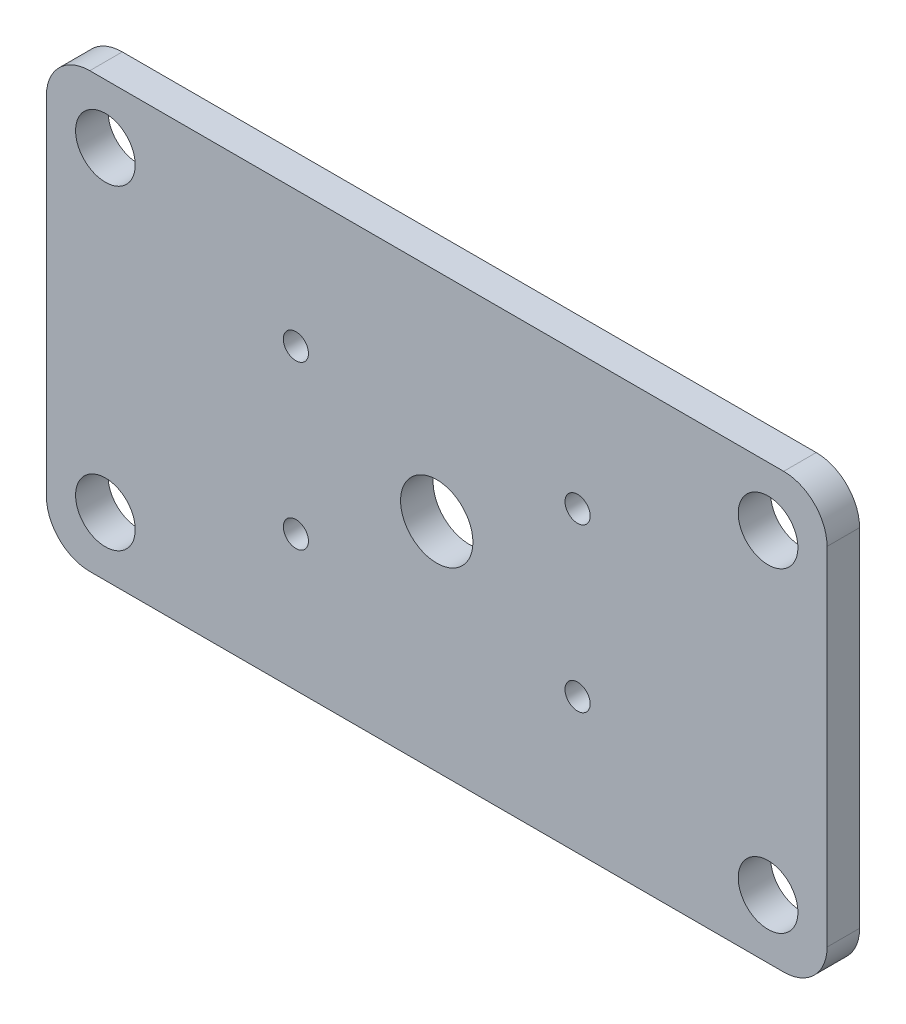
ISO-10303-21;
HEADER;
FILE_DESCRIPTION(('STEP AP214'),'2;1');
FILE_NAME('part.step','',(''),(''),'','','');
FILE_SCHEMA(('AUTOMOTIVE_DESIGN { 1 0 10303 214 1 1 1 1 }'));
ENDSEC;
DATA;
#1=APPLICATION_CONTEXT('core data for automotive mechanical design processes');
#2=APPLICATION_PROTOCOL_DEFINITION('international standard','automotive_design',2000,#1);
#3=PRODUCT_CONTEXT('',#1,'mechanical');
#4=PRODUCT('Part','Part','',(#3));
#5=PRODUCT_RELATED_PRODUCT_CATEGORY('part','',(#4));
#6=PRODUCT_DEFINITION_FORMATION('','',#4);
#7=PRODUCT_DEFINITION_CONTEXT('part definition',#1,'design');
#8=PRODUCT_DEFINITION('design','',#6,#7);
#9=PRODUCT_DEFINITION_SHAPE('','',#8);
#10=(LENGTH_UNIT() NAMED_UNIT(*) SI_UNIT(.MILLI.,.METRE.));
#11=(NAMED_UNIT(*) PLANE_ANGLE_UNIT() SI_UNIT($,.RADIAN.));
#12=(NAMED_UNIT(*) SI_UNIT($,.STERADIAN.) SOLID_ANGLE_UNIT());
#13=UNCERTAINTY_MEASURE_WITH_UNIT(LENGTH_MEASURE(1.E-05),#10,'distance_accuracy_value','');
#14=(GEOMETRIC_REPRESENTATION_CONTEXT(3) GLOBAL_UNCERTAINTY_ASSIGNED_CONTEXT((#13)) GLOBAL_UNIT_ASSIGNED_CONTEXT((#10,
#11,#12)) REPRESENTATION_CONTEXT('',''));
#15=CARTESIAN_POINT('',(0.,0.,0.));
#16=DIRECTION('',(0.,0.,1.));
#17=DIRECTION('',(1.,0.,0.));
#18=AXIS2_PLACEMENT_3D('',#15,#16,#17);
#19=CARTESIAN_POINT('',(50.8,-25.4,0.));
#20=DIRECTION('',(0.,0.,1.));
#21=DIRECTION('',(1.,0.,0.));
#22=AXIS2_PLACEMENT_3D('',#19,#20,#21);
#23=CYLINDRICAL_SURFACE('',#22,6.35000000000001);
#24=CARTESIAN_POINT('',(50.8,-25.4,4.7625));
#25=DIRECTION('',(0.,0.,1.));
#26=DIRECTION('',(1.,0.,0.));
#27=AXIS2_PLACEMENT_3D('',#24,#25,#26);
#28=CIRCLE('',#27,6.35000000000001);
#29=CARTESIAN_POINT('',(50.8,-31.75,4.7625));
#30=VERTEX_POINT('',#29);
#31=CARTESIAN_POINT('',(57.15,-25.4,4.7625));
#32=VERTEX_POINT('',#31);
#33=EDGE_CURVE('E130',#30,#32,#28,.T.);
#34=ORIENTED_EDGE('',*,*,#33,.F.);
#35=DIRECTION('',(0.,0.,1.));
#36=VECTOR('',#35,1.);
#37=CARTESIAN_POINT('',(50.8,-31.75,0.));
#38=LINE('',#37,#36);
#39=CARTESIAN_POINT('',(50.8,-31.75,0.));
#40=VERTEX_POINT('',#39);
#41=EDGE_CURVE('E11',#40,#30,#38,.T.);
#42=ORIENTED_EDGE('',*,*,#41,.F.);
#43=CARTESIAN_POINT('',(50.8,-25.4,0.));
#44=DIRECTION('',(0.,0.,1.));
#45=DIRECTION('',(1.,0.,0.));
#46=AXIS2_PLACEMENT_3D('',#43,#44,#45);
#47=CIRCLE('',#46,6.35000000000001);
#48=CARTESIAN_POINT('',(57.15,-25.4,0.));
#49=VERTEX_POINT('',#48);
#50=EDGE_CURVE('E151',#40,#49,#47,.T.);
#51=ORIENTED_EDGE('',*,*,#50,.T.);
#52=DIRECTION('',(0.,0.,1.));
#53=VECTOR('',#52,1.);
#54=CARTESIAN_POINT('',(57.15,-25.4,0.));
#55=LINE('',#54,#53);
#56=EDGE_CURVE('E36',#49,#32,#55,.T.);
#57=ORIENTED_EDGE('',*,*,#56,.T.);
#58=EDGE_LOOP('',(#34,#42,#51,#57));
#59=FACE_BOUND('',#58,.T.);
#60=ADVANCED_FACE('F33',(#59),#23,.T.);
#61=CARTESIAN_POINT('',(-50.8,-31.7500000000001,0.));
#62=DIRECTION('',(0.,-1.,0.));
#63=DIRECTION('',(1.,0.,0.));
#64=AXIS2_PLACEMENT_3D('',#61,#62,#63);
#65=PLANE('',#64);
#66=DIRECTION('',(1.,0.,0.));
#67=VECTOR('',#66,1.);
#68=CARTESIAN_POINT('',(-50.8,-31.7500000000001,4.7625));
#69=LINE('',#68,#67);
#70=CARTESIAN_POINT('',(-50.8,-31.75,4.7625));
#71=VERTEX_POINT('',#70);
#72=EDGE_CURVE('E149',#71,#30,#69,.T.);
#73=ORIENTED_EDGE('',*,*,#72,.F.);
#74=DIRECTION('',(0.,0.,1.));
#75=VECTOR('',#74,1.);
#76=CARTESIAN_POINT('',(-50.8,-31.75,0.));
#77=LINE('',#76,#75);
#78=CARTESIAN_POINT('',(-50.8,-31.75,0.));
#79=VERTEX_POINT('',#78);
#80=EDGE_CURVE('E42',#79,#71,#77,.T.);
#81=ORIENTED_EDGE('',*,*,#80,.F.);
#82=DIRECTION('',(1.,0.,0.));
#83=VECTOR('',#82,1.);
#84=CARTESIAN_POINT('',(-50.8,-31.7500000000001,0.));
#85=LINE('',#84,#83);
#86=EDGE_CURVE('E120',#79,#40,#85,.T.);
#87=ORIENTED_EDGE('',*,*,#86,.T.);
#88=ORIENTED_EDGE('',*,*,#41,.T.);
#89=EDGE_LOOP('',(#73,#81,#87,#88));
#90=FACE_BOUND('',#89,.T.);
#91=ADVANCED_FACE('F163',(#90),#65,.T.);
#92=CARTESIAN_POINT('',(-50.8,-25.4,0.));
#93=DIRECTION('',(0.,0.,1.));
#94=DIRECTION('',(1.,0.,0.));
#95=AXIS2_PLACEMENT_3D('',#92,#93,#94);
#96=CYLINDRICAL_SURFACE('',#95,6.35000000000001);
#97=CARTESIAN_POINT('',(-50.8,-25.4,4.7625));
#98=DIRECTION('',(0.,0.,1.));
#99=DIRECTION('',(1.,0.,0.));
#100=AXIS2_PLACEMENT_3D('',#97,#98,#99);
#101=CIRCLE('',#100,6.35000000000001);
#102=CARTESIAN_POINT('',(-57.15,-25.4,4.7625));
#103=VERTEX_POINT('',#102);
#104=EDGE_CURVE('E107',#103,#71,#101,.T.);
#105=ORIENTED_EDGE('',*,*,#104,.F.);
#106=DIRECTION('',(0.,0.,1.));
#107=VECTOR('',#106,1.);
#108=CARTESIAN_POINT('',(-57.15,-25.4,0.));
#109=LINE('',#108,#107);
#110=CARTESIAN_POINT('',(-57.15,-25.4,0.));
#111=VERTEX_POINT('',#110);
#112=EDGE_CURVE('E102',#111,#103,#109,.T.);
#113=ORIENTED_EDGE('',*,*,#112,.F.);
#114=CARTESIAN_POINT('',(-50.8,-25.4,0.));
#115=DIRECTION('',(0.,0.,1.));
#116=DIRECTION('',(1.,0.,0.));
#117=AXIS2_PLACEMENT_3D('',#114,#115,#116);
#118=CIRCLE('',#117,6.35000000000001);
#119=EDGE_CURVE('E105',#111,#79,#118,.T.);
#120=ORIENTED_EDGE('',*,*,#119,.T.);
#121=ORIENTED_EDGE('',*,*,#80,.T.);
#122=EDGE_LOOP('',(#105,#113,#120,#121));
#123=FACE_BOUND('',#122,.T.);
#124=ADVANCED_FACE('F104',(#123),#96,.T.);
#125=CARTESIAN_POINT('',(-57.15,25.4,0.));
#126=DIRECTION('',(-1.,0.,0.));
#127=DIRECTION('',(0.,-1.,0.));
#128=AXIS2_PLACEMENT_3D('',#125,#126,#127);
#129=PLANE('',#128);
#130=DIRECTION('',(0.,-1.,0.));
#131=VECTOR('',#130,1.);
#132=CARTESIAN_POINT('',(-57.15,25.4,4.7625));
#133=LINE('',#132,#131);
#134=CARTESIAN_POINT('',(-57.15,25.4,4.7625));
#135=VERTEX_POINT('',#134);
#136=EDGE_CURVE('E146',#135,#103,#133,.T.);
#137=ORIENTED_EDGE('',*,*,#136,.F.);
#138=DIRECTION('',(0.,0.,1.));
#139=VECTOR('',#138,1.);
#140=CARTESIAN_POINT('',(-57.15,25.4,0.));
#141=LINE('',#140,#139);
#142=CARTESIAN_POINT('',(-57.15,25.4,0.));
#143=VERTEX_POINT('',#142);
#144=EDGE_CURVE('E112',#143,#135,#141,.T.);
#145=ORIENTED_EDGE('',*,*,#144,.F.);
#146=DIRECTION('',(0.,-1.,0.));
#147=VECTOR('',#146,1.);
#148=CARTESIAN_POINT('',(-57.15,25.4,0.));
#149=LINE('',#148,#147);
#150=EDGE_CURVE('E118',#143,#111,#149,.T.);
#151=ORIENTED_EDGE('',*,*,#150,.T.);
#152=ORIENTED_EDGE('',*,*,#112,.T.);
#153=EDGE_LOOP('',(#137,#145,#151,#152));
#154=FACE_BOUND('',#153,.T.);
#155=ADVANCED_FACE('F122',(#154),#129,.T.);
#156=CARTESIAN_POINT('',(-50.8,25.4,0.));
#157=DIRECTION('',(0.,0.,1.));
#158=DIRECTION('',(1.,0.,0.));
#159=AXIS2_PLACEMENT_3D('',#156,#157,#158);
#160=CYLINDRICAL_SURFACE('',#159,6.34999999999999);
#161=CARTESIAN_POINT('',(-50.8,25.4,4.7625));
#162=DIRECTION('',(0.,0.,1.));
#163=DIRECTION('',(1.,0.,0.));
#164=AXIS2_PLACEMENT_3D('',#161,#162,#163);
#165=CIRCLE('',#164,6.34999999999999);
#166=CARTESIAN_POINT('',(-50.8,31.75,4.7625));
#167=VERTEX_POINT('',#166);
#168=EDGE_CURVE('E143',#167,#135,#165,.T.);
#169=ORIENTED_EDGE('',*,*,#168,.F.);
#170=DIRECTION('',(0.,0.,1.));
#171=VECTOR('',#170,1.);
#172=CARTESIAN_POINT('',(-50.8,31.75,0.));
#173=LINE('',#172,#171);
#174=CARTESIAN_POINT('',(-50.8,31.75,0.));
#175=VERTEX_POINT('',#174);
#176=EDGE_CURVE('E155',#175,#167,#173,.T.);
#177=ORIENTED_EDGE('',*,*,#176,.F.);
#178=CARTESIAN_POINT('',(-50.8,25.4,0.));
#179=DIRECTION('',(0.,0.,1.));
#180=DIRECTION('',(1.,0.,0.));
#181=AXIS2_PLACEMENT_3D('',#178,#179,#180);
#182=CIRCLE('',#181,6.34999999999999);
#183=EDGE_CURVE('E123',#175,#143,#182,.T.);
#184=ORIENTED_EDGE('',*,*,#183,.T.);
#185=ORIENTED_EDGE('',*,*,#144,.T.);
#186=EDGE_LOOP('',(#169,#177,#184,#185));
#187=FACE_BOUND('',#186,.T.);
#188=ADVANCED_FACE('F176',(#187),#160,.T.);
#189=CARTESIAN_POINT('',(50.8,31.75,0.));
#190=DIRECTION('',(0.,1.,0.));
#191=DIRECTION('',(-1.,0.,0.));
#192=AXIS2_PLACEMENT_3D('',#189,#190,#191);
#193=PLANE('',#192);
#194=DIRECTION('',(-1.,0.,0.));
#195=VECTOR('',#194,1.);
#196=CARTESIAN_POINT('',(50.8,31.75,4.7625));
#197=LINE('',#196,#195);
#198=CARTESIAN_POINT('',(50.8,31.75,4.7625));
#199=VERTEX_POINT('',#198);
#200=EDGE_CURVE('E140',#199,#167,#197,.T.);
#201=ORIENTED_EDGE('',*,*,#200,.F.);
#202=DIRECTION('',(0.,0.,1.));
#203=VECTOR('',#202,1.);
#204=CARTESIAN_POINT('',(50.8,31.75,0.));
#205=LINE('',#204,#203);
#206=CARTESIAN_POINT('',(50.8,31.75,0.));
#207=VERTEX_POINT('',#206);
#208=EDGE_CURVE('E157',#207,#199,#205,.T.);
#209=ORIENTED_EDGE('',*,*,#208,.F.);
#210=DIRECTION('',(-1.,0.,0.));
#211=VECTOR('',#210,1.);
#212=CARTESIAN_POINT('',(50.8,31.75,0.));
#213=LINE('',#212,#211);
#214=EDGE_CURVE('E125',#207,#175,#213,.T.);
#215=ORIENTED_EDGE('',*,*,#214,.T.);
#216=ORIENTED_EDGE('',*,*,#176,.T.);
#217=EDGE_LOOP('',(#201,#209,#215,#216));
#218=FACE_BOUND('',#217,.T.);
#219=ADVANCED_FACE('F179',(#218),#193,.T.);
#220=CARTESIAN_POINT('',(50.8,25.4,0.));
#221=DIRECTION('',(0.,0.,1.));
#222=DIRECTION('',(1.,0.,0.));
#223=AXIS2_PLACEMENT_3D('',#220,#221,#222);
#224=CYLINDRICAL_SURFACE('',#223,6.34999999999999);
#225=CARTESIAN_POINT('',(50.8,25.4,4.7625));
#226=DIRECTION('',(0.,0.,1.));
#227=DIRECTION('',(1.,0.,0.));
#228=AXIS2_PLACEMENT_3D('',#225,#226,#227);
#229=CIRCLE('',#228,6.34999999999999);
#230=CARTESIAN_POINT('',(57.15,25.4,4.7625));
#231=VERTEX_POINT('',#230);
#232=EDGE_CURVE('E137',#231,#199,#229,.T.);
#233=ORIENTED_EDGE('',*,*,#232,.F.);
#234=DIRECTION('',(0.,0.,1.));
#235=VECTOR('',#234,1.);
#236=CARTESIAN_POINT('',(57.15,25.4,0.));
#237=LINE('',#236,#235);
#238=CARTESIAN_POINT('',(57.15,25.4,0.));
#239=VERTEX_POINT('',#238);
#240=EDGE_CURVE('E158',#239,#231,#237,.T.);
#241=ORIENTED_EDGE('',*,*,#240,.F.);
#242=CARTESIAN_POINT('',(50.8,25.4,0.));
#243=DIRECTION('',(0.,0.,1.));
#244=DIRECTION('',(1.,0.,0.));
#245=AXIS2_PLACEMENT_3D('',#242,#243,#244);
#246=CIRCLE('',#245,6.34999999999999);
#247=EDGE_CURVE('E295',#239,#207,#246,.T.);
#248=ORIENTED_EDGE('',*,*,#247,.T.);
#249=ORIENTED_EDGE('',*,*,#208,.T.);
#250=EDGE_LOOP('',(#233,#241,#248,#249));
#251=FACE_BOUND('',#250,.T.);
#252=ADVANCED_FACE('F183',(#251),#224,.T.);
#253=CARTESIAN_POINT('',(57.15,-25.4,0.));
#254=DIRECTION('',(1.,0.,0.));
#255=DIRECTION('',(0.,0.,-1.));
#256=AXIS2_PLACEMENT_3D('',#253,#254,#255);
#257=PLANE('',#256);
#258=DIRECTION('',(0.,1.,0.));
#259=VECTOR('',#258,1.);
#260=CARTESIAN_POINT('',(57.15,-25.4,4.7625));
#261=LINE('',#260,#259);
#262=EDGE_CURVE('E133',#32,#231,#261,.T.);
#263=ORIENTED_EDGE('',*,*,#262,.F.);
#264=ORIENTED_EDGE('',*,*,#56,.F.);
#265=DIRECTION('',(0.,1.,0.));
#266=VECTOR('',#265,1.);
#267=CARTESIAN_POINT('',(57.15,-25.4,0.));
#268=LINE('',#267,#266);
#269=EDGE_CURVE('E293',#49,#239,#268,.T.);
#270=ORIENTED_EDGE('',*,*,#269,.T.);
#271=ORIENTED_EDGE('',*,*,#240,.T.);
#272=EDGE_LOOP('',(#263,#264,#270,#271));
#273=FACE_BOUND('',#272,.T.);
#274=ADVANCED_FACE('F160',(#273),#257,.T.);
#275=CARTESIAN_POINT('',(50.8,-25.4,0.));
#276=DIRECTION('',(0.,0.,1.));
#277=DIRECTION('',(1.,0.,0.));
#278=AXIS2_PLACEMENT_3D('',#275,#276,#277);
#279=PLANE('',#278);
#280=CARTESIAN_POINT('',(0.,0.,0.));
#281=DIRECTION('',(0.,0.,1.));
#282=DIRECTION('',(-1.,0.,0.));
#283=AXIS2_PLACEMENT_3D('',#280,#281,#282);
#284=CIRCLE('',#283,5.2959);
#285=CARTESIAN_POINT('',(5.2959,0.,0.));
#286=VERTEX_POINT('',#285);
#287=EDGE_CURVE('E238',#286,#286,#284,.T.);
#288=ORIENTED_EDGE('',*,*,#287,.T.);
#289=EDGE_LOOP('',(#288));
#290=FACE_BOUND('',#289,.T.);
#291=CARTESIAN_POINT('',(-48.514,23.114,0.));
#292=DIRECTION('',(0.,0.,1.));
#293=DIRECTION('',(-1.,0.,0.));
#294=AXIS2_PLACEMENT_3D('',#291,#292,#293);
#295=CIRCLE('',#294,4.36880000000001);
#296=CARTESIAN_POINT('',(-44.1452,23.114,0.));
#297=VERTEX_POINT('',#296);
#298=EDGE_CURVE('E246',#297,#297,#295,.T.);
#299=ORIENTED_EDGE('',*,*,#298,.T.);
#300=EDGE_LOOP('',(#299));
#301=FACE_BOUND('',#300,.T.);
#302=CARTESIAN_POINT('',(-48.514,-23.114,0.));
#303=DIRECTION('',(0.,0.,1.));
#304=DIRECTION('',(-1.,0.,0.));
#305=AXIS2_PLACEMENT_3D('',#302,#303,#304);
#306=CIRCLE('',#305,4.36880000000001);
#307=CARTESIAN_POINT('',(-44.1452,-23.114,0.));
#308=VERTEX_POINT('',#307);
#309=EDGE_CURVE('E252',#308,#308,#306,.T.);
#310=ORIENTED_EDGE('',*,*,#309,.T.);
#311=EDGE_LOOP('',(#310));
#312=FACE_BOUND('',#311,.T.);
#313=CARTESIAN_POINT('',(48.514,23.1140000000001,0.));
#314=DIRECTION('',(0.,0.,1.));
#315=DIRECTION('',(-1.,0.,0.));
#316=AXIS2_PLACEMENT_3D('',#313,#314,#315);
#317=CIRCLE('',#316,4.3688);
#318=CARTESIAN_POINT('',(52.8828,23.1140000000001,0.));
#319=VERTEX_POINT('',#318);
#320=EDGE_CURVE('E258',#319,#319,#317,.T.);
#321=ORIENTED_EDGE('',*,*,#320,.T.);
#322=EDGE_LOOP('',(#321));
#323=FACE_BOUND('',#322,.T.);
#324=CARTESIAN_POINT('',(48.514,-23.1140000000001,0.));
#325=DIRECTION('',(0.,0.,1.));
#326=DIRECTION('',(-1.,0.,0.));
#327=AXIS2_PLACEMENT_3D('',#324,#325,#326);
#328=CIRCLE('',#327,4.36880000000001);
#329=CARTESIAN_POINT('',(52.8828,-23.1140000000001,0.));
#330=VERTEX_POINT('',#329);
#331=EDGE_CURVE('E264',#330,#330,#328,.T.);
#332=ORIENTED_EDGE('',*,*,#331,.T.);
#333=EDGE_LOOP('',(#332));
#334=FACE_BOUND('',#333,.T.);
#335=CARTESIAN_POINT('',(20.622229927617,11.90625,0.));
#336=DIRECTION('',(0.,0.,1.));
#337=DIRECTION('',(-1.,0.,0.));
#338=AXIS2_PLACEMENT_3D('',#335,#336,#337);
#339=CIRCLE('',#338,1.8415);
#340=CARTESIAN_POINT('',(22.463729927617,11.90625,0.));
#341=VERTEX_POINT('',#340);
#342=EDGE_CURVE('E270',#341,#341,#339,.T.);
#343=ORIENTED_EDGE('',*,*,#342,.T.);
#344=EDGE_LOOP('',(#343));
#345=FACE_BOUND('',#344,.T.);
#346=CARTESIAN_POINT('',(20.6222299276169,-11.90625,0.));
#347=DIRECTION('',(0.,0.,1.));
#348=DIRECTION('',(-1.,0.,0.));
#349=AXIS2_PLACEMENT_3D('',#346,#347,#348);
#350=CIRCLE('',#349,1.84149999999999);
#351=CARTESIAN_POINT('',(22.4637299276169,-11.90625,0.));
#352=VERTEX_POINT('',#351);
#353=EDGE_CURVE('E276',#352,#352,#350,.T.);
#354=ORIENTED_EDGE('',*,*,#353,.T.);
#355=EDGE_LOOP('',(#354));
#356=FACE_BOUND('',#355,.T.);
#357=CARTESIAN_POINT('',(-20.6222299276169,-11.90625,0.));
#358=DIRECTION('',(0.,0.,1.));
#359=DIRECTION('',(-1.,0.,0.));
#360=AXIS2_PLACEMENT_3D('',#357,#358,#359);
#361=CIRCLE('',#360,1.8415);
#362=CARTESIAN_POINT('',(-18.7807299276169,-11.90625,0.));
#363=VERTEX_POINT('',#362);
#364=EDGE_CURVE('E282',#363,#363,#361,.T.);
#365=ORIENTED_EDGE('',*,*,#364,.T.);
#366=EDGE_LOOP('',(#365));
#367=FACE_BOUND('',#366,.T.);
#368=CARTESIAN_POINT('',(-20.6222299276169,11.90625,0.));
#369=DIRECTION('',(0.,0.,1.));
#370=DIRECTION('',(-1.,0.,0.));
#371=AXIS2_PLACEMENT_3D('',#368,#369,#370);
#372=CIRCLE('',#371,1.8415);
#373=CARTESIAN_POINT('',(-18.7807299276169,11.90625,0.));
#374=VERTEX_POINT('',#373);
#375=EDGE_CURVE('E134',#374,#374,#372,.T.);
#376=ORIENTED_EDGE('',*,*,#375,.T.);
#377=EDGE_LOOP('',(#376));
#378=FACE_BOUND('',#377,.T.);
#379=ORIENTED_EDGE('',*,*,#50,.F.);
#380=ORIENTED_EDGE('',*,*,#86,.F.);
#381=ORIENTED_EDGE('',*,*,#119,.F.);
#382=ORIENTED_EDGE('',*,*,#150,.F.);
#383=ORIENTED_EDGE('',*,*,#183,.F.);
#384=ORIENTED_EDGE('',*,*,#214,.F.);
#385=ORIENTED_EDGE('',*,*,#247,.F.);
#386=ORIENTED_EDGE('',*,*,#269,.F.);
#387=EDGE_LOOP('',(#379,#380,#381,#382,#383,#384,#385,#386));
#388=FACE_BOUND('',#387,.T.);
#389=ADVANCED_FACE('F116',(#290,#301,#312,#323,#334,#345,#356,#367,#378,#388),#279,.F.);
#390=CARTESIAN_POINT('',(50.8,-25.4,4.7625));
#391=DIRECTION('',(0.,0.,1.));
#392=DIRECTION('',(1.,0.,0.));
#393=AXIS2_PLACEMENT_3D('',#390,#391,#392);
#394=PLANE('',#393);
#395=CARTESIAN_POINT('',(0.,0.,4.7625));
#396=DIRECTION('',(0.,0.,1.));
#397=DIRECTION('',(-1.,0.,0.));
#398=AXIS2_PLACEMENT_3D('',#395,#396,#397);
#399=CIRCLE('',#398,5.2959);
#400=CARTESIAN_POINT('',(5.2959,0.,4.7625));
#401=VERTEX_POINT('',#400);
#402=EDGE_CURVE('E241',#401,#401,#399,.T.);
#403=ORIENTED_EDGE('',*,*,#402,.F.);
#404=EDGE_LOOP('',(#403));
#405=FACE_BOUND('',#404,.T.);
#406=CARTESIAN_POINT('',(-48.514,23.114,4.7625));
#407=DIRECTION('',(0.,0.,1.));
#408=DIRECTION('',(-1.,0.,0.));
#409=AXIS2_PLACEMENT_3D('',#406,#407,#408);
#410=CIRCLE('',#409,4.36880000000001);
#411=CARTESIAN_POINT('',(-44.1452,23.114,4.7625));
#412=VERTEX_POINT('',#411);
#413=EDGE_CURVE('E243',#412,#412,#410,.T.);
#414=ORIENTED_EDGE('',*,*,#413,.F.);
#415=EDGE_LOOP('',(#414));
#416=FACE_BOUND('',#415,.T.);
#417=CARTESIAN_POINT('',(-48.514,-23.114,4.7625));
#418=DIRECTION('',(0.,0.,1.));
#419=DIRECTION('',(-1.,0.,0.));
#420=AXIS2_PLACEMENT_3D('',#417,#418,#419);
#421=CIRCLE('',#420,4.36880000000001);
#422=CARTESIAN_POINT('',(-44.1452,-23.114,4.7625));
#423=VERTEX_POINT('',#422);
#424=EDGE_CURVE('E249',#423,#423,#421,.T.);
#425=ORIENTED_EDGE('',*,*,#424,.F.);
#426=EDGE_LOOP('',(#425));
#427=FACE_BOUND('',#426,.T.);
#428=CARTESIAN_POINT('',(48.514,23.1140000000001,4.7625));
#429=DIRECTION('',(0.,0.,1.));
#430=DIRECTION('',(-1.,0.,0.));
#431=AXIS2_PLACEMENT_3D('',#428,#429,#430);
#432=CIRCLE('',#431,4.3688);
#433=CARTESIAN_POINT('',(52.8828,23.1140000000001,4.7625));
#434=VERTEX_POINT('',#433);
#435=EDGE_CURVE('E255',#434,#434,#432,.T.);
#436=ORIENTED_EDGE('',*,*,#435,.F.);
#437=EDGE_LOOP('',(#436));
#438=FACE_BOUND('',#437,.T.);
#439=CARTESIAN_POINT('',(48.514,-23.1140000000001,4.7625));
#440=DIRECTION('',(0.,0.,1.));
#441=DIRECTION('',(-1.,0.,0.));
#442=AXIS2_PLACEMENT_3D('',#439,#440,#441);
#443=CIRCLE('',#442,4.36880000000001);
#444=CARTESIAN_POINT('',(52.8828,-23.1140000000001,4.7625));
#445=VERTEX_POINT('',#444);
#446=EDGE_CURVE('E261',#445,#445,#443,.T.);
#447=ORIENTED_EDGE('',*,*,#446,.F.);
#448=EDGE_LOOP('',(#447));
#449=FACE_BOUND('',#448,.T.);
#450=CARTESIAN_POINT('',(20.622229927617,11.90625,4.7625));
#451=DIRECTION('',(0.,0.,1.));
#452=DIRECTION('',(-1.,0.,0.));
#453=AXIS2_PLACEMENT_3D('',#450,#451,#452);
#454=CIRCLE('',#453,1.8415);
#455=CARTESIAN_POINT('',(22.463729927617,11.90625,4.7625));
#456=VERTEX_POINT('',#455);
#457=EDGE_CURVE('E267',#456,#456,#454,.T.);
#458=ORIENTED_EDGE('',*,*,#457,.F.);
#459=EDGE_LOOP('',(#458));
#460=FACE_BOUND('',#459,.T.);
#461=CARTESIAN_POINT('',(20.6222299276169,-11.90625,4.7625));
#462=DIRECTION('',(0.,0.,1.));
#463=DIRECTION('',(-1.,0.,0.));
#464=AXIS2_PLACEMENT_3D('',#461,#462,#463);
#465=CIRCLE('',#464,1.84149999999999);
#466=CARTESIAN_POINT('',(22.4637299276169,-11.90625,4.7625));
#467=VERTEX_POINT('',#466);
#468=EDGE_CURVE('E273',#467,#467,#465,.T.);
#469=ORIENTED_EDGE('',*,*,#468,.F.);
#470=EDGE_LOOP('',(#469));
#471=FACE_BOUND('',#470,.T.);
#472=CARTESIAN_POINT('',(-20.6222299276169,-11.90625,4.7625));
#473=DIRECTION('',(0.,0.,1.));
#474=DIRECTION('',(-1.,0.,0.));
#475=AXIS2_PLACEMENT_3D('',#472,#473,#474);
#476=CIRCLE('',#475,1.8415);
#477=CARTESIAN_POINT('',(-18.7807299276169,-11.90625,4.7625));
#478=VERTEX_POINT('',#477);
#479=EDGE_CURVE('E279',#478,#478,#476,.T.);
#480=ORIENTED_EDGE('',*,*,#479,.F.);
#481=EDGE_LOOP('',(#480));
#482=FACE_BOUND('',#481,.T.);
#483=CARTESIAN_POINT('',(-20.6222299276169,11.90625,4.7625));
#484=DIRECTION('',(0.,0.,1.));
#485=DIRECTION('',(-1.,0.,0.));
#486=AXIS2_PLACEMENT_3D('',#483,#484,#485);
#487=CIRCLE('',#486,1.8415);
#488=CARTESIAN_POINT('',(-18.7807299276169,11.90625,4.7625));
#489=VERTEX_POINT('',#488);
#490=EDGE_CURVE('E285',#489,#489,#487,.T.);
#491=ORIENTED_EDGE('',*,*,#490,.F.);
#492=EDGE_LOOP('',(#491));
#493=FACE_BOUND('',#492,.T.);
#494=ORIENTED_EDGE('',*,*,#33,.T.);
#495=ORIENTED_EDGE('',*,*,#262,.T.);
#496=ORIENTED_EDGE('',*,*,#232,.T.);
#497=ORIENTED_EDGE('',*,*,#200,.T.);
#498=ORIENTED_EDGE('',*,*,#168,.T.);
#499=ORIENTED_EDGE('',*,*,#136,.T.);
#500=ORIENTED_EDGE('',*,*,#104,.T.);
#501=ORIENTED_EDGE('',*,*,#72,.T.);
#502=EDGE_LOOP('',(#494,#495,#496,#497,#498,#499,#500,#501));
#503=FACE_BOUND('',#502,.T.);
#504=ADVANCED_FACE('F162',(#405,#416,#427,#438,#449,#460,#471,#482,#493,#503),#394,.T.);
#505=CARTESIAN_POINT('',(-20.6222299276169,11.90625,0.));
#506=DIRECTION('',(0.,0.,1.));
#507=DIRECTION('',(1.,0.,0.));
#508=AXIS2_PLACEMENT_3D('',#505,#506,#507);
#509=CYLINDRICAL_SURFACE('',#508,1.8415);
#510=CARTESIAN_POINT('',(-18.7807299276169,11.90625,0.));
#511=CARTESIAN_POINT('',(-18.7807299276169,11.90625,0.049609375));
#512=CARTESIAN_POINT('',(-18.7807299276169,11.90625,0.09921875));
#513=CARTESIAN_POINT('',(-18.7807299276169,11.90625,0.1984375));
#514=CARTESIAN_POINT('',(-18.7807299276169,11.90625,0.248046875));
#515=CARTESIAN_POINT('',(-18.7807299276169,11.90625,0.347265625));
#516=CARTESIAN_POINT('',(-18.7807299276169,11.90625,0.396875));
#517=CARTESIAN_POINT('',(-18.7807299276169,11.90625,0.49609375));
#518=CARTESIAN_POINT('',(-18.7807299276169,11.90625,0.545703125));
#519=CARTESIAN_POINT('',(-18.7807299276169,11.90625,0.644921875));
#520=CARTESIAN_POINT('',(-18.7807299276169,11.90625,0.69453125));
#521=CARTESIAN_POINT('',(-18.7807299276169,11.90625,0.79375));
#522=CARTESIAN_POINT('',(-18.7807299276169,11.90625,0.843359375));
#523=CARTESIAN_POINT('',(-18.7807299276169,11.90625,0.942578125));
#524=CARTESIAN_POINT('',(-18.7807299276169,11.90625,0.9921875));
#525=CARTESIAN_POINT('',(-18.7807299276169,11.90625,1.09140625));
#526=CARTESIAN_POINT('',(-18.7807299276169,11.90625,1.141015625));
#527=CARTESIAN_POINT('',(-18.7807299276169,11.90625,1.240234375));
#528=CARTESIAN_POINT('',(-18.7807299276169,11.90625,1.28984375));
#529=CARTESIAN_POINT('',(-18.7807299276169,11.90625,1.3890625));
#530=CARTESIAN_POINT('',(-18.7807299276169,11.90625,1.438671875));
#531=CARTESIAN_POINT('',(-18.7807299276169,11.90625,1.537890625));
#532=CARTESIAN_POINT('',(-18.7807299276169,11.90625,1.5875));
#533=CARTESIAN_POINT('',(-18.7807299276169,11.90625,1.68671875));
#534=CARTESIAN_POINT('',(-18.7807299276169,11.90625,1.736328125));
#535=CARTESIAN_POINT('',(-18.7807299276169,11.90625,1.835546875));
#536=CARTESIAN_POINT('',(-18.7807299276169,11.90625,1.88515625));
#537=CARTESIAN_POINT('',(-18.7807299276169,11.90625,1.984375));
#538=CARTESIAN_POINT('',(-18.7807299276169,11.90625,2.033984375));
#539=CARTESIAN_POINT('',(-18.7807299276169,11.90625,2.133203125));
#540=CARTESIAN_POINT('',(-18.7807299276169,11.90625,2.1828125));
#541=CARTESIAN_POINT('',(-18.7807299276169,11.90625,2.28203125));
#542=CARTESIAN_POINT('',(-18.7807299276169,11.90625,2.331640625));
#543=CARTESIAN_POINT('',(-18.7807299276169,11.90625,2.430859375));
#544=CARTESIAN_POINT('',(-18.7807299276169,11.90625,2.48046875));
#545=CARTESIAN_POINT('',(-18.7807299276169,11.90625,2.5796875));
#546=CARTESIAN_POINT('',(-18.7807299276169,11.90625,2.629296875));
#547=CARTESIAN_POINT('',(-18.7807299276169,11.90625,2.728515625));
#548=CARTESIAN_POINT('',(-18.7807299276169,11.90625,2.778125));
#549=CARTESIAN_POINT('',(-18.7807299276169,11.90625,2.87734375));
#550=CARTESIAN_POINT('',(-18.7807299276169,11.90625,2.926953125));
#551=CARTESIAN_POINT('',(-18.7807299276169,11.90625,3.026171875));
#552=CARTESIAN_POINT('',(-18.7807299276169,11.90625,3.07578125));
#553=CARTESIAN_POINT('',(-18.7807299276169,11.90625,3.175));
#554=CARTESIAN_POINT('',(-18.7807299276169,11.90625,3.224609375));
#555=CARTESIAN_POINT('',(-18.7807299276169,11.90625,3.323828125));
#556=CARTESIAN_POINT('',(-18.7807299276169,11.90625,3.3734375));
#557=CARTESIAN_POINT('',(-18.7807299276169,11.90625,3.47265625));
#558=CARTESIAN_POINT('',(-18.7807299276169,11.90625,3.522265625));
#559=CARTESIAN_POINT('',(-18.7807299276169,11.90625,3.621484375));
#560=CARTESIAN_POINT('',(-18.7807299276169,11.90625,3.67109375));
#561=CARTESIAN_POINT('',(-18.7807299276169,11.90625,3.7703125));
#562=CARTESIAN_POINT('',(-18.7807299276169,11.90625,3.819921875));
#563=CARTESIAN_POINT('',(-18.7807299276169,11.90625,3.919140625));
#564=CARTESIAN_POINT('',(-18.7807299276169,11.90625,3.96875));
#565=CARTESIAN_POINT('',(-18.7807299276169,11.90625,4.06796875));
#566=CARTESIAN_POINT('',(-18.7807299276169,11.90625,4.117578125));
#567=CARTESIAN_POINT('',(-18.7807299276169,11.90625,4.216796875));
#568=CARTESIAN_POINT('',(-18.7807299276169,11.90625,4.26640625));
#569=CARTESIAN_POINT('',(-18.7807299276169,11.90625,4.365625));
#570=CARTESIAN_POINT('',(-18.7807299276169,11.90625,4.415234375));
#571=CARTESIAN_POINT('',(-18.7807299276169,11.90625,4.514453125));
#572=CARTESIAN_POINT('',(-18.7807299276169,11.90625,4.5640625));
#573=CARTESIAN_POINT('',(-18.7807299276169,11.90625,4.66328125));
#574=CARTESIAN_POINT('',(-18.7807299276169,11.90625,4.712890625));
#575=CARTESIAN_POINT('',(-18.7807299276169,11.90625,4.7625));
#576=B_SPLINE_CURVE_WITH_KNOTS('',3,(#510,#511,#512,#513,#514,#515,#516,#517,#518,#519,#520,
#521,#522,#523,#524,#525,#526,#527,#528,#529,#530,#531,#532,#533,#534,#535,#536,#537,#538,#539,
#540,#541,#542,#543,#544,#545,#546,#547,#548,#549,#550,#551,#552,#553,#554,#555,#556,#557,#558,
#559,#560,#561,#562,#563,#564,#565,#566,#567,#568,#569,#570,#571,#572,#573,#574,#575),
.UNSPECIFIED.,.F.,.F.,(4,2,2,2,2,2,2,2,2,2,2,2,2,2,2,2,2,2,2,2,2,2,2,2,2,2,2,2,2,2,2,2,4),(0.,
0.148828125,0.29765625,0.446484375,0.5953125,0.744140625,0.89296875,1.041796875,1.190625,
1.339453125,1.48828125,1.637109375,1.7859375,1.934765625,2.08359375,2.232421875,2.38125,
2.530078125,2.67890625,2.827734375,2.9765625,3.125390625,3.27421875,3.423046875,3.571875,
3.720703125,3.86953125,4.018359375,4.1671875,4.316015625,4.46484375,4.613671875,4.7625),.UNSPECIFIED.);
#577=EDGE_CURVE('BSEAM195',#374,#489,#576,.T.);
#578=ORIENTED_EDGE('',*,*,#375,.F.);
#579=ORIENTED_EDGE('',*,*,#490,.T.);
#580=ORIENTED_EDGE('',*,*,#577,.T.);
#581=ORIENTED_EDGE('',*,*,#577,.F.);
#582=EDGE_LOOP('',(#578,#580,#579,#581));
#583=FACE_BOUND('',#582,.T.);
#584=ADVANCED_FACE('F195',(#583),#509,.F.);
#585=CARTESIAN_POINT('',(-20.6222299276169,-11.90625,0.));
#586=DIRECTION('',(0.,0.,1.));
#587=DIRECTION('',(1.,0.,0.));
#588=AXIS2_PLACEMENT_3D('',#585,#586,#587);
#589=CYLINDRICAL_SURFACE('',#588,1.8415);
#590=CARTESIAN_POINT('',(-18.7807299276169,-11.90625,0.));
#591=CARTESIAN_POINT('',(-18.7807299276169,-11.90625,0.049609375));
#592=CARTESIAN_POINT('',(-18.7807299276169,-11.90625,0.09921875));
#593=CARTESIAN_POINT('',(-18.7807299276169,-11.90625,0.1984375));
#594=CARTESIAN_POINT('',(-18.7807299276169,-11.90625,0.248046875));
#595=CARTESIAN_POINT('',(-18.7807299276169,-11.90625,0.347265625));
#596=CARTESIAN_POINT('',(-18.7807299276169,-11.90625,0.396875));
#597=CARTESIAN_POINT('',(-18.7807299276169,-11.90625,0.49609375));
#598=CARTESIAN_POINT('',(-18.7807299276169,-11.90625,0.545703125));
#599=CARTESIAN_POINT('',(-18.7807299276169,-11.90625,0.644921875));
#600=CARTESIAN_POINT('',(-18.7807299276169,-11.90625,0.69453125));
#601=CARTESIAN_POINT('',(-18.7807299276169,-11.90625,0.79375));
#602=CARTESIAN_POINT('',(-18.7807299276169,-11.90625,0.843359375));
#603=CARTESIAN_POINT('',(-18.7807299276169,-11.90625,0.942578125));
#604=CARTESIAN_POINT('',(-18.7807299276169,-11.90625,0.9921875));
#605=CARTESIAN_POINT('',(-18.7807299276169,-11.90625,1.09140625));
#606=CARTESIAN_POINT('',(-18.7807299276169,-11.90625,1.141015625));
#607=CARTESIAN_POINT('',(-18.7807299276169,-11.90625,1.240234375));
#608=CARTESIAN_POINT('',(-18.7807299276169,-11.90625,1.28984375));
#609=CARTESIAN_POINT('',(-18.7807299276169,-11.90625,1.3890625));
#610=CARTESIAN_POINT('',(-18.7807299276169,-11.90625,1.438671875));
#611=CARTESIAN_POINT('',(-18.7807299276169,-11.90625,1.537890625));
#612=CARTESIAN_POINT('',(-18.7807299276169,-11.90625,1.5875));
#613=CARTESIAN_POINT('',(-18.7807299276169,-11.90625,1.68671875));
#614=CARTESIAN_POINT('',(-18.7807299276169,-11.90625,1.736328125));
#615=CARTESIAN_POINT('',(-18.7807299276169,-11.90625,1.835546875));
#616=CARTESIAN_POINT('',(-18.7807299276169,-11.90625,1.88515625));
#617=CARTESIAN_POINT('',(-18.7807299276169,-11.90625,1.984375));
#618=CARTESIAN_POINT('',(-18.7807299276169,-11.90625,2.033984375));
#619=CARTESIAN_POINT('',(-18.7807299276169,-11.90625,2.133203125));
#620=CARTESIAN_POINT('',(-18.7807299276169,-11.90625,2.1828125));
#621=CARTESIAN_POINT('',(-18.7807299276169,-11.90625,2.28203125));
#622=CARTESIAN_POINT('',(-18.7807299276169,-11.90625,2.331640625));
#623=CARTESIAN_POINT('',(-18.7807299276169,-11.90625,2.430859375));
#624=CARTESIAN_POINT('',(-18.7807299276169,-11.90625,2.48046875));
#625=CARTESIAN_POINT('',(-18.7807299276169,-11.90625,2.5796875));
#626=CARTESIAN_POINT('',(-18.7807299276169,-11.90625,2.629296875));
#627=CARTESIAN_POINT('',(-18.7807299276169,-11.90625,2.728515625));
#628=CARTESIAN_POINT('',(-18.7807299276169,-11.90625,2.778125));
#629=CARTESIAN_POINT('',(-18.7807299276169,-11.90625,2.87734375));
#630=CARTESIAN_POINT('',(-18.7807299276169,-11.90625,2.926953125));
#631=CARTESIAN_POINT('',(-18.7807299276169,-11.90625,3.026171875));
#632=CARTESIAN_POINT('',(-18.7807299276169,-11.90625,3.07578125));
#633=CARTESIAN_POINT('',(-18.7807299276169,-11.90625,3.175));
#634=CARTESIAN_POINT('',(-18.7807299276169,-11.90625,3.224609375));
#635=CARTESIAN_POINT('',(-18.7807299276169,-11.90625,3.323828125));
#636=CARTESIAN_POINT('',(-18.7807299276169,-11.90625,3.3734375));
#637=CARTESIAN_POINT('',(-18.7807299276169,-11.90625,3.47265625));
#638=CARTESIAN_POINT('',(-18.7807299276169,-11.90625,3.522265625));
#639=CARTESIAN_POINT('',(-18.7807299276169,-11.90625,3.621484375));
#640=CARTESIAN_POINT('',(-18.7807299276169,-11.90625,3.67109375));
#641=CARTESIAN_POINT('',(-18.7807299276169,-11.90625,3.7703125));
#642=CARTESIAN_POINT('',(-18.7807299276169,-11.90625,3.819921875));
#643=CARTESIAN_POINT('',(-18.7807299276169,-11.90625,3.919140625));
#644=CARTESIAN_POINT('',(-18.7807299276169,-11.90625,3.96875));
#645=CARTESIAN_POINT('',(-18.7807299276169,-11.90625,4.06796875));
#646=CARTESIAN_POINT('',(-18.7807299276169,-11.90625,4.117578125));
#647=CARTESIAN_POINT('',(-18.7807299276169,-11.90625,4.216796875));
#648=CARTESIAN_POINT('',(-18.7807299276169,-11.90625,4.26640625));
#649=CARTESIAN_POINT('',(-18.7807299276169,-11.90625,4.365625));
#650=CARTESIAN_POINT('',(-18.7807299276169,-11.90625,4.415234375));
#651=CARTESIAN_POINT('',(-18.7807299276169,-11.90625,4.514453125));
#652=CARTESIAN_POINT('',(-18.7807299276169,-11.90625,4.5640625));
#653=CARTESIAN_POINT('',(-18.7807299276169,-11.90625,4.66328125));
#654=CARTESIAN_POINT('',(-18.7807299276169,-11.90625,4.712890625));
#655=CARTESIAN_POINT('',(-18.7807299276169,-11.90625,4.7625));
#656=B_SPLINE_CURVE_WITH_KNOTS('',3,(#590,#591,#592,#593,#594,#595,#596,#597,#598,#599,#600,
#601,#602,#603,#604,#605,#606,#607,#608,#609,#610,#611,#612,#613,#614,#615,#616,#617,#618,#619,
#620,#621,#622,#623,#624,#625,#626,#627,#628,#629,#630,#631,#632,#633,#634,#635,#636,#637,#638,
#639,#640,#641,#642,#643,#644,#645,#646,#647,#648,#649,#650,#651,#652,#653,#654,#655),
.UNSPECIFIED.,.F.,.F.,(4,2,2,2,2,2,2,2,2,2,2,2,2,2,2,2,2,2,2,2,2,2,2,2,2,2,2,2,2,2,2,2,4),(0.,
0.148828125,0.29765625,0.446484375,0.5953125,0.744140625,0.89296875,1.041796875,1.190625,
1.339453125,1.48828125,1.637109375,1.7859375,1.934765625,2.08359375,2.232421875,2.38125,
2.530078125,2.67890625,2.827734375,2.9765625,3.125390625,3.27421875,3.423046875,3.571875,
3.720703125,3.86953125,4.018359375,4.1671875,4.316015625,4.46484375,4.613671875,4.7625),.UNSPECIFIED.);
#657=EDGE_CURVE('BSEAM202',#363,#478,#656,.T.);
#658=ORIENTED_EDGE('',*,*,#364,.F.);
#659=ORIENTED_EDGE('',*,*,#479,.T.);
#660=ORIENTED_EDGE('',*,*,#657,.T.);
#661=ORIENTED_EDGE('',*,*,#657,.F.);
#662=EDGE_LOOP('',(#658,#660,#659,#661));
#663=FACE_BOUND('',#662,.T.);
#664=ADVANCED_FACE('F202',(#663),#589,.F.);
#665=CARTESIAN_POINT('',(20.6222299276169,-11.90625,0.));
#666=DIRECTION('',(0.,0.,1.));
#667=DIRECTION('',(1.,0.,0.));
#668=AXIS2_PLACEMENT_3D('',#665,#666,#667);
#669=CYLINDRICAL_SURFACE('',#668,1.84149999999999);
#670=CARTESIAN_POINT('',(22.4637299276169,-11.90625,0.));
#671=CARTESIAN_POINT('',(22.4637299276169,-11.90625,0.049609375));
#672=CARTESIAN_POINT('',(22.4637299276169,-11.90625,0.09921875));
#673=CARTESIAN_POINT('',(22.4637299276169,-11.90625,0.1984375));
#674=CARTESIAN_POINT('',(22.4637299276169,-11.90625,0.248046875));
#675=CARTESIAN_POINT('',(22.4637299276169,-11.90625,0.347265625));
#676=CARTESIAN_POINT('',(22.4637299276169,-11.90625,0.396875));
#677=CARTESIAN_POINT('',(22.4637299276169,-11.90625,0.49609375));
#678=CARTESIAN_POINT('',(22.4637299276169,-11.90625,0.545703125));
#679=CARTESIAN_POINT('',(22.4637299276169,-11.90625,0.644921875));
#680=CARTESIAN_POINT('',(22.4637299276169,-11.90625,0.69453125));
#681=CARTESIAN_POINT('',(22.4637299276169,-11.90625,0.79375));
#682=CARTESIAN_POINT('',(22.4637299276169,-11.90625,0.843359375));
#683=CARTESIAN_POINT('',(22.4637299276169,-11.90625,0.942578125));
#684=CARTESIAN_POINT('',(22.4637299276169,-11.90625,0.9921875));
#685=CARTESIAN_POINT('',(22.4637299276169,-11.90625,1.09140625));
#686=CARTESIAN_POINT('',(22.4637299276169,-11.90625,1.141015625));
#687=CARTESIAN_POINT('',(22.4637299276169,-11.90625,1.240234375));
#688=CARTESIAN_POINT('',(22.4637299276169,-11.90625,1.28984375));
#689=CARTESIAN_POINT('',(22.4637299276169,-11.90625,1.3890625));
#690=CARTESIAN_POINT('',(22.4637299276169,-11.90625,1.438671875));
#691=CARTESIAN_POINT('',(22.4637299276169,-11.90625,1.537890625));
#692=CARTESIAN_POINT('',(22.4637299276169,-11.90625,1.5875));
#693=CARTESIAN_POINT('',(22.4637299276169,-11.90625,1.68671875));
#694=CARTESIAN_POINT('',(22.4637299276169,-11.90625,1.736328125));
#695=CARTESIAN_POINT('',(22.4637299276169,-11.90625,1.835546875));
#696=CARTESIAN_POINT('',(22.4637299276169,-11.90625,1.88515625));
#697=CARTESIAN_POINT('',(22.4637299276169,-11.90625,1.984375));
#698=CARTESIAN_POINT('',(22.4637299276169,-11.90625,2.033984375));
#699=CARTESIAN_POINT('',(22.4637299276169,-11.90625,2.133203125));
#700=CARTESIAN_POINT('',(22.4637299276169,-11.90625,2.1828125));
#701=CARTESIAN_POINT('',(22.4637299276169,-11.90625,2.28203125));
#702=CARTESIAN_POINT('',(22.4637299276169,-11.90625,2.331640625));
#703=CARTESIAN_POINT('',(22.4637299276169,-11.90625,2.430859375));
#704=CARTESIAN_POINT('',(22.4637299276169,-11.90625,2.48046875));
#705=CARTESIAN_POINT('',(22.4637299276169,-11.90625,2.5796875));
#706=CARTESIAN_POINT('',(22.4637299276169,-11.90625,2.629296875));
#707=CARTESIAN_POINT('',(22.4637299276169,-11.90625,2.728515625));
#708=CARTESIAN_POINT('',(22.4637299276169,-11.90625,2.778125));
#709=CARTESIAN_POINT('',(22.4637299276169,-11.90625,2.87734375));
#710=CARTESIAN_POINT('',(22.4637299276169,-11.90625,2.926953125));
#711=CARTESIAN_POINT('',(22.4637299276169,-11.90625,3.026171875));
#712=CARTESIAN_POINT('',(22.4637299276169,-11.90625,3.07578125));
#713=CARTESIAN_POINT('',(22.4637299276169,-11.90625,3.175));
#714=CARTESIAN_POINT('',(22.4637299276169,-11.90625,3.224609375));
#715=CARTESIAN_POINT('',(22.4637299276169,-11.90625,3.323828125));
#716=CARTESIAN_POINT('',(22.4637299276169,-11.90625,3.3734375));
#717=CARTESIAN_POINT('',(22.4637299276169,-11.90625,3.47265625));
#718=CARTESIAN_POINT('',(22.4637299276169,-11.90625,3.522265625));
#719=CARTESIAN_POINT('',(22.4637299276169,-11.90625,3.621484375));
#720=CARTESIAN_POINT('',(22.4637299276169,-11.90625,3.67109375));
#721=CARTESIAN_POINT('',(22.4637299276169,-11.90625,3.7703125));
#722=CARTESIAN_POINT('',(22.4637299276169,-11.90625,3.819921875));
#723=CARTESIAN_POINT('',(22.4637299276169,-11.90625,3.919140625));
#724=CARTESIAN_POINT('',(22.4637299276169,-11.90625,3.96875));
#725=CARTESIAN_POINT('',(22.4637299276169,-11.90625,4.06796875));
#726=CARTESIAN_POINT('',(22.4637299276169,-11.90625,4.117578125));
#727=CARTESIAN_POINT('',(22.4637299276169,-11.90625,4.216796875));
#728=CARTESIAN_POINT('',(22.4637299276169,-11.90625,4.26640625));
#729=CARTESIAN_POINT('',(22.4637299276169,-11.90625,4.365625));
#730=CARTESIAN_POINT('',(22.4637299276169,-11.90625,4.415234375));
#731=CARTESIAN_POINT('',(22.4637299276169,-11.90625,4.514453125));
#732=CARTESIAN_POINT('',(22.4637299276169,-11.90625,4.5640625));
#733=CARTESIAN_POINT('',(22.4637299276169,-11.90625,4.66328125));
#734=CARTESIAN_POINT('',(22.4637299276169,-11.90625,4.712890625));
#735=CARTESIAN_POINT('',(22.4637299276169,-11.90625,4.7625));
#736=B_SPLINE_CURVE_WITH_KNOTS('',3,(#670,#671,#672,#673,#674,#675,#676,#677,#678,#679,#680,
#681,#682,#683,#684,#685,#686,#687,#688,#689,#690,#691,#692,#693,#694,#695,#696,#697,#698,#699,
#700,#701,#702,#703,#704,#705,#706,#707,#708,#709,#710,#711,#712,#713,#714,#715,#716,#717,#718,
#719,#720,#721,#722,#723,#724,#725,#726,#727,#728,#729,#730,#731,#732,#733,#734,#735),
.UNSPECIFIED.,.F.,.F.,(4,2,2,2,2,2,2,2,2,2,2,2,2,2,2,2,2,2,2,2,2,2,2,2,2,2,2,2,2,2,2,2,4),(0.,
0.148828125,0.29765625,0.446484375,0.5953125,0.744140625,0.89296875,1.041796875,1.190625,
1.339453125,1.48828125,1.637109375,1.7859375,1.934765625,2.08359375,2.232421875,2.38125,
2.530078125,2.67890625,2.827734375,2.9765625,3.125390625,3.27421875,3.423046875,3.571875,
3.720703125,3.86953125,4.018359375,4.1671875,4.316015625,4.46484375,4.613671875,4.7625),.UNSPECIFIED.);
#737=EDGE_CURVE('BSEAM206',#352,#467,#736,.T.);
#738=ORIENTED_EDGE('',*,*,#353,.F.);
#739=ORIENTED_EDGE('',*,*,#468,.T.);
#740=ORIENTED_EDGE('',*,*,#737,.T.);
#741=ORIENTED_EDGE('',*,*,#737,.F.);
#742=EDGE_LOOP('',(#738,#740,#739,#741));
#743=FACE_BOUND('',#742,.T.);
#744=ADVANCED_FACE('F206',(#743),#669,.F.);
#745=CARTESIAN_POINT('',(20.622229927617,11.90625,0.));
#746=DIRECTION('',(0.,0.,1.));
#747=DIRECTION('',(1.,0.,0.));
#748=AXIS2_PLACEMENT_3D('',#745,#746,#747);
#749=CYLINDRICAL_SURFACE('',#748,1.8415);
#750=CARTESIAN_POINT('',(22.463729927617,11.90625,0.));
#751=CARTESIAN_POINT('',(22.463729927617,11.90625,0.049609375));
#752=CARTESIAN_POINT('',(22.463729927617,11.90625,0.09921875));
#753=CARTESIAN_POINT('',(22.463729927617,11.90625,0.1984375));
#754=CARTESIAN_POINT('',(22.463729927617,11.90625,0.248046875));
#755=CARTESIAN_POINT('',(22.463729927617,11.90625,0.347265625));
#756=CARTESIAN_POINT('',(22.463729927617,11.90625,0.396875));
#757=CARTESIAN_POINT('',(22.463729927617,11.90625,0.49609375));
#758=CARTESIAN_POINT('',(22.463729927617,11.90625,0.545703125));
#759=CARTESIAN_POINT('',(22.463729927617,11.90625,0.644921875));
#760=CARTESIAN_POINT('',(22.463729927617,11.90625,0.69453125));
#761=CARTESIAN_POINT('',(22.463729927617,11.90625,0.79375));
#762=CARTESIAN_POINT('',(22.463729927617,11.90625,0.843359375));
#763=CARTESIAN_POINT('',(22.463729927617,11.90625,0.942578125));
#764=CARTESIAN_POINT('',(22.463729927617,11.90625,0.9921875));
#765=CARTESIAN_POINT('',(22.463729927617,11.90625,1.09140625));
#766=CARTESIAN_POINT('',(22.463729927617,11.90625,1.141015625));
#767=CARTESIAN_POINT('',(22.463729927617,11.90625,1.240234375));
#768=CARTESIAN_POINT('',(22.463729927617,11.90625,1.28984375));
#769=CARTESIAN_POINT('',(22.463729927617,11.90625,1.3890625));
#770=CARTESIAN_POINT('',(22.463729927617,11.90625,1.438671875));
#771=CARTESIAN_POINT('',(22.463729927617,11.90625,1.537890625));
#772=CARTESIAN_POINT('',(22.463729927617,11.90625,1.5875));
#773=CARTESIAN_POINT('',(22.463729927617,11.90625,1.68671875));
#774=CARTESIAN_POINT('',(22.463729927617,11.90625,1.736328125));
#775=CARTESIAN_POINT('',(22.463729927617,11.90625,1.835546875));
#776=CARTESIAN_POINT('',(22.463729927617,11.90625,1.88515625));
#777=CARTESIAN_POINT('',(22.463729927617,11.90625,1.984375));
#778=CARTESIAN_POINT('',(22.463729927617,11.90625,2.033984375));
#779=CARTESIAN_POINT('',(22.463729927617,11.90625,2.133203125));
#780=CARTESIAN_POINT('',(22.463729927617,11.90625,2.1828125));
#781=CARTESIAN_POINT('',(22.463729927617,11.90625,2.28203125));
#782=CARTESIAN_POINT('',(22.463729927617,11.90625,2.331640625));
#783=CARTESIAN_POINT('',(22.463729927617,11.90625,2.430859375));
#784=CARTESIAN_POINT('',(22.463729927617,11.90625,2.48046875));
#785=CARTESIAN_POINT('',(22.463729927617,11.90625,2.5796875));
#786=CARTESIAN_POINT('',(22.463729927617,11.90625,2.629296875));
#787=CARTESIAN_POINT('',(22.463729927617,11.90625,2.728515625));
#788=CARTESIAN_POINT('',(22.463729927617,11.90625,2.778125));
#789=CARTESIAN_POINT('',(22.463729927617,11.90625,2.87734375));
#790=CARTESIAN_POINT('',(22.463729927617,11.90625,2.926953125));
#791=CARTESIAN_POINT('',(22.463729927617,11.90625,3.026171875));
#792=CARTESIAN_POINT('',(22.463729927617,11.90625,3.07578125));
#793=CARTESIAN_POINT('',(22.463729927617,11.90625,3.175));
#794=CARTESIAN_POINT('',(22.463729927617,11.90625,3.224609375));
#795=CARTESIAN_POINT('',(22.463729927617,11.90625,3.323828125));
#796=CARTESIAN_POINT('',(22.463729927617,11.90625,3.3734375));
#797=CARTESIAN_POINT('',(22.463729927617,11.90625,3.47265625));
#798=CARTESIAN_POINT('',(22.463729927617,11.90625,3.522265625));
#799=CARTESIAN_POINT('',(22.463729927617,11.90625,3.621484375));
#800=CARTESIAN_POINT('',(22.463729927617,11.90625,3.67109375));
#801=CARTESIAN_POINT('',(22.463729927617,11.90625,3.7703125));
#802=CARTESIAN_POINT('',(22.463729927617,11.90625,3.819921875));
#803=CARTESIAN_POINT('',(22.463729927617,11.90625,3.919140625));
#804=CARTESIAN_POINT('',(22.463729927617,11.90625,3.96875));
#805=CARTESIAN_POINT('',(22.463729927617,11.90625,4.06796875));
#806=CARTESIAN_POINT('',(22.463729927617,11.90625,4.117578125));
#807=CARTESIAN_POINT('',(22.463729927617,11.90625,4.216796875));
#808=CARTESIAN_POINT('',(22.463729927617,11.90625,4.26640625));
#809=CARTESIAN_POINT('',(22.463729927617,11.90625,4.365625));
#810=CARTESIAN_POINT('',(22.463729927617,11.90625,4.415234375));
#811=CARTESIAN_POINT('',(22.463729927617,11.90625,4.514453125));
#812=CARTESIAN_POINT('',(22.463729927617,11.90625,4.5640625));
#813=CARTESIAN_POINT('',(22.463729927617,11.90625,4.66328125));
#814=CARTESIAN_POINT('',(22.463729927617,11.90625,4.712890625));
#815=CARTESIAN_POINT('',(22.463729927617,11.90625,4.7625));
#816=B_SPLINE_CURVE_WITH_KNOTS('',3,(#750,#751,#752,#753,#754,#755,#756,#757,#758,#759,#760,
#761,#762,#763,#764,#765,#766,#767,#768,#769,#770,#771,#772,#773,#774,#775,#776,#777,#778,#779,
#780,#781,#782,#783,#784,#785,#786,#787,#788,#789,#790,#791,#792,#793,#794,#795,#796,#797,#798,
#799,#800,#801,#802,#803,#804,#805,#806,#807,#808,#809,#810,#811,#812,#813,#814,#815),
.UNSPECIFIED.,.F.,.F.,(4,2,2,2,2,2,2,2,2,2,2,2,2,2,2,2,2,2,2,2,2,2,2,2,2,2,2,2,2,2,2,2,4),(0.,
0.148828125,0.29765625,0.446484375,0.5953125,0.744140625,0.89296875,1.041796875,1.190625,
1.339453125,1.48828125,1.637109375,1.7859375,1.934765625,2.08359375,2.232421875,2.38125,
2.530078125,2.67890625,2.827734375,2.9765625,3.125390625,3.27421875,3.423046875,3.571875,
3.720703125,3.86953125,4.018359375,4.1671875,4.316015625,4.46484375,4.613671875,4.7625),.UNSPECIFIED.);
#817=EDGE_CURVE('BSEAM210',#341,#456,#816,.T.);
#818=ORIENTED_EDGE('',*,*,#342,.F.);
#819=ORIENTED_EDGE('',*,*,#457,.T.);
#820=ORIENTED_EDGE('',*,*,#817,.T.);
#821=ORIENTED_EDGE('',*,*,#817,.F.);
#822=EDGE_LOOP('',(#818,#820,#819,#821));
#823=FACE_BOUND('',#822,.T.);
#824=ADVANCED_FACE('F210',(#823),#749,.F.);
#825=CARTESIAN_POINT('',(48.514,-23.1140000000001,0.));
#826=DIRECTION('',(0.,0.,1.));
#827=DIRECTION('',(1.,0.,0.));
#828=AXIS2_PLACEMENT_3D('',#825,#826,#827);
#829=CYLINDRICAL_SURFACE('',#828,4.36880000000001);
#830=CARTESIAN_POINT('',(52.8828,-23.1140000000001,0.));
#831=CARTESIAN_POINT('',(52.8828,-23.1140000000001,0.049609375));
#832=CARTESIAN_POINT('',(52.8828,-23.1140000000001,0.09921875));
#833=CARTESIAN_POINT('',(52.8828,-23.1140000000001,0.1984375));
#834=CARTESIAN_POINT('',(52.8828,-23.1140000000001,0.248046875));
#835=CARTESIAN_POINT('',(52.8828,-23.1140000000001,0.347265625));
#836=CARTESIAN_POINT('',(52.8828,-23.1140000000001,0.396875));
#837=CARTESIAN_POINT('',(52.8828,-23.1140000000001,0.49609375));
#838=CARTESIAN_POINT('',(52.8828,-23.1140000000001,0.545703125));
#839=CARTESIAN_POINT('',(52.8828,-23.1140000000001,0.644921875));
#840=CARTESIAN_POINT('',(52.8828,-23.1140000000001,0.69453125));
#841=CARTESIAN_POINT('',(52.8828,-23.1140000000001,0.79375));
#842=CARTESIAN_POINT('',(52.8828,-23.1140000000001,0.843359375));
#843=CARTESIAN_POINT('',(52.8828,-23.1140000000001,0.942578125));
#844=CARTESIAN_POINT('',(52.8828,-23.1140000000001,0.9921875));
#845=CARTESIAN_POINT('',(52.8828,-23.1140000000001,1.09140625));
#846=CARTESIAN_POINT('',(52.8828,-23.1140000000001,1.141015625));
#847=CARTESIAN_POINT('',(52.8828,-23.1140000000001,1.240234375));
#848=CARTESIAN_POINT('',(52.8828,-23.1140000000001,1.28984375));
#849=CARTESIAN_POINT('',(52.8828,-23.1140000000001,1.3890625));
#850=CARTESIAN_POINT('',(52.8828,-23.1140000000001,1.438671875));
#851=CARTESIAN_POINT('',(52.8828,-23.1140000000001,1.537890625));
#852=CARTESIAN_POINT('',(52.8828,-23.1140000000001,1.5875));
#853=CARTESIAN_POINT('',(52.8828,-23.1140000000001,1.68671875));
#854=CARTESIAN_POINT('',(52.8828,-23.1140000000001,1.736328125));
#855=CARTESIAN_POINT('',(52.8828,-23.1140000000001,1.835546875));
#856=CARTESIAN_POINT('',(52.8828,-23.1140000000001,1.88515625));
#857=CARTESIAN_POINT('',(52.8828,-23.1140000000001,1.984375));
#858=CARTESIAN_POINT('',(52.8828,-23.1140000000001,2.033984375));
#859=CARTESIAN_POINT('',(52.8828,-23.1140000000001,2.133203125));
#860=CARTESIAN_POINT('',(52.8828,-23.1140000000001,2.1828125));
#861=CARTESIAN_POINT('',(52.8828,-23.1140000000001,2.28203125));
#862=CARTESIAN_POINT('',(52.8828,-23.1140000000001,2.331640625));
#863=CARTESIAN_POINT('',(52.8828,-23.1140000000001,2.430859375));
#864=CARTESIAN_POINT('',(52.8828,-23.1140000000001,2.48046875));
#865=CARTESIAN_POINT('',(52.8828,-23.1140000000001,2.5796875));
#866=CARTESIAN_POINT('',(52.8828,-23.1140000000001,2.629296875));
#867=CARTESIAN_POINT('',(52.8828,-23.1140000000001,2.728515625));
#868=CARTESIAN_POINT('',(52.8828,-23.1140000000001,2.778125));
#869=CARTESIAN_POINT('',(52.8828,-23.1140000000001,2.87734375));
#870=CARTESIAN_POINT('',(52.8828,-23.1140000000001,2.926953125));
#871=CARTESIAN_POINT('',(52.8828,-23.1140000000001,3.026171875));
#872=CARTESIAN_POINT('',(52.8828,-23.1140000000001,3.07578125));
#873=CARTESIAN_POINT('',(52.8828,-23.1140000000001,3.175));
#874=CARTESIAN_POINT('',(52.8828,-23.1140000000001,3.224609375));
#875=CARTESIAN_POINT('',(52.8828,-23.1140000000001,3.323828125));
#876=CARTESIAN_POINT('',(52.8828,-23.1140000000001,3.3734375));
#877=CARTESIAN_POINT('',(52.8828,-23.1140000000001,3.47265625));
#878=CARTESIAN_POINT('',(52.8828,-23.1140000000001,3.522265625));
#879=CARTESIAN_POINT('',(52.8828,-23.1140000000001,3.621484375));
#880=CARTESIAN_POINT('',(52.8828,-23.1140000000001,3.67109375));
#881=CARTESIAN_POINT('',(52.8828,-23.1140000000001,3.7703125));
#882=CARTESIAN_POINT('',(52.8828,-23.1140000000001,3.819921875));
#883=CARTESIAN_POINT('',(52.8828,-23.1140000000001,3.919140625));
#884=CARTESIAN_POINT('',(52.8828,-23.1140000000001,3.96875));
#885=CARTESIAN_POINT('',(52.8828,-23.1140000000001,4.06796875));
#886=CARTESIAN_POINT('',(52.8828,-23.1140000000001,4.117578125));
#887=CARTESIAN_POINT('',(52.8828,-23.1140000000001,4.216796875));
#888=CARTESIAN_POINT('',(52.8828,-23.1140000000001,4.26640625));
#889=CARTESIAN_POINT('',(52.8828,-23.1140000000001,4.365625));
#890=CARTESIAN_POINT('',(52.8828,-23.1140000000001,4.415234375));
#891=CARTESIAN_POINT('',(52.8828,-23.1140000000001,4.514453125));
#892=CARTESIAN_POINT('',(52.8828,-23.1140000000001,4.5640625));
#893=CARTESIAN_POINT('',(52.8828,-23.1140000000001,4.66328125));
#894=CARTESIAN_POINT('',(52.8828,-23.1140000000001,4.712890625));
#895=CARTESIAN_POINT('',(52.8828,-23.1140000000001,4.7625));
#896=B_SPLINE_CURVE_WITH_KNOTS('',3,(#830,#831,#832,#833,#834,#835,#836,#837,#838,#839,#840,
#841,#842,#843,#844,#845,#846,#847,#848,#849,#850,#851,#852,#853,#854,#855,#856,#857,#858,#859,
#860,#861,#862,#863,#864,#865,#866,#867,#868,#869,#870,#871,#872,#873,#874,#875,#876,#877,#878,
#879,#880,#881,#882,#883,#884,#885,#886,#887,#888,#889,#890,#891,#892,#893,#894,#895),
.UNSPECIFIED.,.F.,.F.,(4,2,2,2,2,2,2,2,2,2,2,2,2,2,2,2,2,2,2,2,2,2,2,2,2,2,2,2,2,2,2,2,4),(0.,
0.148828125,0.29765625,0.446484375,0.5953125,0.744140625,0.89296875,1.041796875,1.190625,
1.339453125,1.48828125,1.637109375,1.7859375,1.934765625,2.08359375,2.232421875,2.38125,
2.530078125,2.67890625,2.827734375,2.9765625,3.125390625,3.27421875,3.423046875,3.571875,
3.720703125,3.86953125,4.018359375,4.1671875,4.316015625,4.46484375,4.613671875,4.7625),.UNSPECIFIED.);
#897=EDGE_CURVE('BSEAM214',#330,#445,#896,.T.);
#898=ORIENTED_EDGE('',*,*,#331,.F.);
#899=ORIENTED_EDGE('',*,*,#446,.T.);
#900=ORIENTED_EDGE('',*,*,#897,.T.);
#901=ORIENTED_EDGE('',*,*,#897,.F.);
#902=EDGE_LOOP('',(#898,#900,#899,#901));
#903=FACE_BOUND('',#902,.T.);
#904=ADVANCED_FACE('F214',(#903),#829,.F.);
#905=CARTESIAN_POINT('',(48.514,23.1140000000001,0.));
#906=DIRECTION('',(0.,0.,1.));
#907=DIRECTION('',(1.,0.,0.));
#908=AXIS2_PLACEMENT_3D('',#905,#906,#907);
#909=CYLINDRICAL_SURFACE('',#908,4.3688);
#910=CARTESIAN_POINT('',(52.8828,23.1140000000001,0.));
#911=CARTESIAN_POINT('',(52.8828,23.1140000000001,0.049609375));
#912=CARTESIAN_POINT('',(52.8828,23.1140000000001,0.09921875));
#913=CARTESIAN_POINT('',(52.8828,23.1140000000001,0.1984375));
#914=CARTESIAN_POINT('',(52.8828,23.1140000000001,0.248046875));
#915=CARTESIAN_POINT('',(52.8828,23.1140000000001,0.347265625));
#916=CARTESIAN_POINT('',(52.8828,23.1140000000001,0.396875));
#917=CARTESIAN_POINT('',(52.8828,23.1140000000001,0.49609375));
#918=CARTESIAN_POINT('',(52.8828,23.1140000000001,0.545703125));
#919=CARTESIAN_POINT('',(52.8828,23.1140000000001,0.644921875));
#920=CARTESIAN_POINT('',(52.8828,23.1140000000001,0.69453125));
#921=CARTESIAN_POINT('',(52.8828,23.1140000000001,0.79375));
#922=CARTESIAN_POINT('',(52.8828,23.1140000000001,0.843359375));
#923=CARTESIAN_POINT('',(52.8828,23.1140000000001,0.942578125));
#924=CARTESIAN_POINT('',(52.8828,23.1140000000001,0.9921875));
#925=CARTESIAN_POINT('',(52.8828,23.1140000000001,1.09140625));
#926=CARTESIAN_POINT('',(52.8828,23.1140000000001,1.141015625));
#927=CARTESIAN_POINT('',(52.8828,23.1140000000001,1.240234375));
#928=CARTESIAN_POINT('',(52.8828,23.1140000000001,1.28984375));
#929=CARTESIAN_POINT('',(52.8828,23.1140000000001,1.3890625));
#930=CARTESIAN_POINT('',(52.8828,23.1140000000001,1.438671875));
#931=CARTESIAN_POINT('',(52.8828,23.1140000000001,1.537890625));
#932=CARTESIAN_POINT('',(52.8828,23.1140000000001,1.5875));
#933=CARTESIAN_POINT('',(52.8828,23.1140000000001,1.68671875));
#934=CARTESIAN_POINT('',(52.8828,23.1140000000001,1.736328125));
#935=CARTESIAN_POINT('',(52.8828,23.1140000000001,1.835546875));
#936=CARTESIAN_POINT('',(52.8828,23.1140000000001,1.88515625));
#937=CARTESIAN_POINT('',(52.8828,23.1140000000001,1.984375));
#938=CARTESIAN_POINT('',(52.8828,23.1140000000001,2.033984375));
#939=CARTESIAN_POINT('',(52.8828,23.1140000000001,2.133203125));
#940=CARTESIAN_POINT('',(52.8828,23.1140000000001,2.1828125));
#941=CARTESIAN_POINT('',(52.8828,23.1140000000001,2.28203125));
#942=CARTESIAN_POINT('',(52.8828,23.1140000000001,2.331640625));
#943=CARTESIAN_POINT('',(52.8828,23.1140000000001,2.430859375));
#944=CARTESIAN_POINT('',(52.8828,23.1140000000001,2.48046875));
#945=CARTESIAN_POINT('',(52.8828,23.1140000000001,2.5796875));
#946=CARTESIAN_POINT('',(52.8828,23.1140000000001,2.629296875));
#947=CARTESIAN_POINT('',(52.8828,23.1140000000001,2.728515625));
#948=CARTESIAN_POINT('',(52.8828,23.1140000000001,2.778125));
#949=CARTESIAN_POINT('',(52.8828,23.1140000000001,2.87734375));
#950=CARTESIAN_POINT('',(52.8828,23.1140000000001,2.926953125));
#951=CARTESIAN_POINT('',(52.8828,23.1140000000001,3.026171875));
#952=CARTESIAN_POINT('',(52.8828,23.1140000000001,3.07578125));
#953=CARTESIAN_POINT('',(52.8828,23.1140000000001,3.175));
#954=CARTESIAN_POINT('',(52.8828,23.1140000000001,3.224609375));
#955=CARTESIAN_POINT('',(52.8828,23.1140000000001,3.323828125));
#956=CARTESIAN_POINT('',(52.8828,23.1140000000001,3.3734375));
#957=CARTESIAN_POINT('',(52.8828,23.1140000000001,3.47265625));
#958=CARTESIAN_POINT('',(52.8828,23.1140000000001,3.522265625));
#959=CARTESIAN_POINT('',(52.8828,23.1140000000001,3.621484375));
#960=CARTESIAN_POINT('',(52.8828,23.1140000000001,3.67109375));
#961=CARTESIAN_POINT('',(52.8828,23.1140000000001,3.7703125));
#962=CARTESIAN_POINT('',(52.8828,23.1140000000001,3.819921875));
#963=CARTESIAN_POINT('',(52.8828,23.1140000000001,3.919140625));
#964=CARTESIAN_POINT('',(52.8828,23.1140000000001,3.96875));
#965=CARTESIAN_POINT('',(52.8828,23.1140000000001,4.06796875));
#966=CARTESIAN_POINT('',(52.8828,23.1140000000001,4.117578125));
#967=CARTESIAN_POINT('',(52.8828,23.1140000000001,4.216796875));
#968=CARTESIAN_POINT('',(52.8828,23.1140000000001,4.26640625));
#969=CARTESIAN_POINT('',(52.8828,23.1140000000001,4.365625));
#970=CARTESIAN_POINT('',(52.8828,23.1140000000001,4.415234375));
#971=CARTESIAN_POINT('',(52.8828,23.1140000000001,4.514453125));
#972=CARTESIAN_POINT('',(52.8828,23.1140000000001,4.5640625));
#973=CARTESIAN_POINT('',(52.8828,23.1140000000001,4.66328125));
#974=CARTESIAN_POINT('',(52.8828,23.1140000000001,4.712890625));
#975=CARTESIAN_POINT('',(52.8828,23.1140000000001,4.7625));
#976=B_SPLINE_CURVE_WITH_KNOTS('',3,(#910,#911,#912,#913,#914,#915,#916,#917,#918,#919,#920,
#921,#922,#923,#924,#925,#926,#927,#928,#929,#930,#931,#932,#933,#934,#935,#936,#937,#938,#939,
#940,#941,#942,#943,#944,#945,#946,#947,#948,#949,#950,#951,#952,#953,#954,#955,#956,#957,#958,
#959,#960,#961,#962,#963,#964,#965,#966,#967,#968,#969,#970,#971,#972,#973,#974,#975),
.UNSPECIFIED.,.F.,.F.,(4,2,2,2,2,2,2,2,2,2,2,2,2,2,2,2,2,2,2,2,2,2,2,2,2,2,2,2,2,2,2,2,4),(0.,
0.148828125,0.29765625,0.446484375,0.5953125,0.744140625,0.89296875,1.041796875,1.190625,
1.339453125,1.48828125,1.637109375,1.7859375,1.934765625,2.08359375,2.232421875,2.38125,
2.530078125,2.67890625,2.827734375,2.9765625,3.125390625,3.27421875,3.423046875,3.571875,
3.720703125,3.86953125,4.018359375,4.1671875,4.316015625,4.46484375,4.613671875,4.7625),.UNSPECIFIED.);
#977=EDGE_CURVE('BSEAM218',#319,#434,#976,.T.);
#978=ORIENTED_EDGE('',*,*,#320,.F.);
#979=ORIENTED_EDGE('',*,*,#435,.T.);
#980=ORIENTED_EDGE('',*,*,#977,.T.);
#981=ORIENTED_EDGE('',*,*,#977,.F.);
#982=EDGE_LOOP('',(#978,#980,#979,#981));
#983=FACE_BOUND('',#982,.T.);
#984=ADVANCED_FACE('F218',(#983),#909,.F.);
#985=CARTESIAN_POINT('',(-48.514,-23.114,0.));
#986=DIRECTION('',(0.,0.,1.));
#987=DIRECTION('',(1.,0.,0.));
#988=AXIS2_PLACEMENT_3D('',#985,#986,#987);
#989=CYLINDRICAL_SURFACE('',#988,4.36880000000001);
#990=CARTESIAN_POINT('',(-44.1452,-23.114,0.));
#991=CARTESIAN_POINT('',(-44.1452,-23.114,0.049609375));
#992=CARTESIAN_POINT('',(-44.1452,-23.114,0.09921875));
#993=CARTESIAN_POINT('',(-44.1452,-23.114,0.1984375));
#994=CARTESIAN_POINT('',(-44.1452,-23.114,0.248046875));
#995=CARTESIAN_POINT('',(-44.1452,-23.114,0.347265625));
#996=CARTESIAN_POINT('',(-44.1452,-23.114,0.396875));
#997=CARTESIAN_POINT('',(-44.1452,-23.114,0.49609375));
#998=CARTESIAN_POINT('',(-44.1452,-23.114,0.545703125));
#999=CARTESIAN_POINT('',(-44.1452,-23.114,0.644921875));
#1000=CARTESIAN_POINT('',(-44.1452,-23.114,0.69453125));
#1001=CARTESIAN_POINT('',(-44.1452,-23.114,0.79375));
#1002=CARTESIAN_POINT('',(-44.1452,-23.114,0.843359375));
#1003=CARTESIAN_POINT('',(-44.1452,-23.114,0.942578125));
#1004=CARTESIAN_POINT('',(-44.1452,-23.114,0.9921875));
#1005=CARTESIAN_POINT('',(-44.1452,-23.114,1.09140625));
#1006=CARTESIAN_POINT('',(-44.1452,-23.114,1.141015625));
#1007=CARTESIAN_POINT('',(-44.1452,-23.114,1.240234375));
#1008=CARTESIAN_POINT('',(-44.1452,-23.114,1.28984375));
#1009=CARTESIAN_POINT('',(-44.1452,-23.114,1.3890625));
#1010=CARTESIAN_POINT('',(-44.1452,-23.114,1.438671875));
#1011=CARTESIAN_POINT('',(-44.1452,-23.114,1.537890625));
#1012=CARTESIAN_POINT('',(-44.1452,-23.114,1.5875));
#1013=CARTESIAN_POINT('',(-44.1452,-23.114,1.68671875));
#1014=CARTESIAN_POINT('',(-44.1452,-23.114,1.736328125));
#1015=CARTESIAN_POINT('',(-44.1452,-23.114,1.835546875));
#1016=CARTESIAN_POINT('',(-44.1452,-23.114,1.88515625));
#1017=CARTESIAN_POINT('',(-44.1452,-23.114,1.984375));
#1018=CARTESIAN_POINT('',(-44.1452,-23.114,2.033984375));
#1019=CARTESIAN_POINT('',(-44.1452,-23.114,2.133203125));
#1020=CARTESIAN_POINT('',(-44.1452,-23.114,2.1828125));
#1021=CARTESIAN_POINT('',(-44.1452,-23.114,2.28203125));
#1022=CARTESIAN_POINT('',(-44.1452,-23.114,2.331640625));
#1023=CARTESIAN_POINT('',(-44.1452,-23.114,2.430859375));
#1024=CARTESIAN_POINT('',(-44.1452,-23.114,2.48046875));
#1025=CARTESIAN_POINT('',(-44.1452,-23.114,2.5796875));
#1026=CARTESIAN_POINT('',(-44.1452,-23.114,2.629296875));
#1027=CARTESIAN_POINT('',(-44.1452,-23.114,2.728515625));
#1028=CARTESIAN_POINT('',(-44.1452,-23.114,2.778125));
#1029=CARTESIAN_POINT('',(-44.1452,-23.114,2.87734375));
#1030=CARTESIAN_POINT('',(-44.1452,-23.114,2.926953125));
#1031=CARTESIAN_POINT('',(-44.1452,-23.114,3.026171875));
#1032=CARTESIAN_POINT('',(-44.1452,-23.114,3.07578125));
#1033=CARTESIAN_POINT('',(-44.1452,-23.114,3.175));
#1034=CARTESIAN_POINT('',(-44.1452,-23.114,3.224609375));
#1035=CARTESIAN_POINT('',(-44.1452,-23.114,3.323828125));
#1036=CARTESIAN_POINT('',(-44.1452,-23.114,3.3734375));
#1037=CARTESIAN_POINT('',(-44.1452,-23.114,3.47265625));
#1038=CARTESIAN_POINT('',(-44.1452,-23.114,3.522265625));
#1039=CARTESIAN_POINT('',(-44.1452,-23.114,3.621484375));
#1040=CARTESIAN_POINT('',(-44.1452,-23.114,3.67109375));
#1041=CARTESIAN_POINT('',(-44.1452,-23.114,3.7703125));
#1042=CARTESIAN_POINT('',(-44.1452,-23.114,3.819921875));
#1043=CARTESIAN_POINT('',(-44.1452,-23.114,3.919140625));
#1044=CARTESIAN_POINT('',(-44.1452,-23.114,3.96875));
#1045=CARTESIAN_POINT('',(-44.1452,-23.114,4.06796875));
#1046=CARTESIAN_POINT('',(-44.1452,-23.114,4.117578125));
#1047=CARTESIAN_POINT('',(-44.1452,-23.114,4.216796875));
#1048=CARTESIAN_POINT('',(-44.1452,-23.114,4.26640625));
#1049=CARTESIAN_POINT('',(-44.1452,-23.114,4.365625));
#1050=CARTESIAN_POINT('',(-44.1452,-23.114,4.415234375));
#1051=CARTESIAN_POINT('',(-44.1452,-23.114,4.514453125));
#1052=CARTESIAN_POINT('',(-44.1452,-23.114,4.5640625));
#1053=CARTESIAN_POINT('',(-44.1452,-23.114,4.66328125));
#1054=CARTESIAN_POINT('',(-44.1452,-23.114,4.712890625));
#1055=CARTESIAN_POINT('',(-44.1452,-23.114,4.7625));
#1056=B_SPLINE_CURVE_WITH_KNOTS('',3,(#990,#991,#992,#993,#994,#995,#996,#997,#998,#999,#1000,
#1001,#1002,#1003,#1004,#1005,#1006,#1007,#1008,#1009,#1010,#1011,#1012,#1013,#1014,#1015,#1016,
#1017,#1018,#1019,#1020,#1021,#1022,#1023,#1024,#1025,#1026,#1027,#1028,#1029,#1030,#1031,#1032,
#1033,#1034,#1035,#1036,#1037,#1038,#1039,#1040,#1041,#1042,#1043,#1044,#1045,#1046,#1047,#1048,
#1049,#1050,#1051,#1052,#1053,#1054,#1055),.UNSPECIFIED.,.F.,.F.,(4,2,2,2,2,2,2,2,2,2,2,2,2,2,2,
2,2,2,2,2,2,2,2,2,2,2,2,2,2,2,2,2,4),(0.,0.148828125,0.29765625,0.446484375,0.5953125,
0.744140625,0.89296875,1.041796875,1.190625,1.339453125,1.48828125,1.637109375,1.7859375,
1.934765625,2.08359375,2.232421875,2.38125,2.530078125,2.67890625,2.827734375,2.9765625,
3.125390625,3.27421875,3.423046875,3.571875,3.720703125,3.86953125,4.018359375,4.1671875,
4.316015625,4.46484375,4.613671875,4.7625),.UNSPECIFIED.);
#1057=EDGE_CURVE('BSEAM222',#308,#423,#1056,.T.);
#1058=ORIENTED_EDGE('',*,*,#309,.F.);
#1059=ORIENTED_EDGE('',*,*,#424,.T.);
#1060=ORIENTED_EDGE('',*,*,#1057,.T.);
#1061=ORIENTED_EDGE('',*,*,#1057,.F.);
#1062=EDGE_LOOP('',(#1058,#1060,#1059,#1061));
#1063=FACE_BOUND('',#1062,.T.);
#1064=ADVANCED_FACE('F222',(#1063),#989,.F.);
#1065=CARTESIAN_POINT('',(-48.514,23.114,0.));
#1066=DIRECTION('',(0.,0.,1.));
#1067=DIRECTION('',(1.,0.,0.));
#1068=AXIS2_PLACEMENT_3D('',#1065,#1066,#1067);
#1069=CYLINDRICAL_SURFACE('',#1068,4.36880000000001);
#1070=CARTESIAN_POINT('',(-44.1452,23.114,0.));
#1071=CARTESIAN_POINT('',(-44.1452,23.114,0.049609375));
#1072=CARTESIAN_POINT('',(-44.1452,23.114,0.09921875));
#1073=CARTESIAN_POINT('',(-44.1452,23.114,0.1984375));
#1074=CARTESIAN_POINT('',(-44.1452,23.114,0.248046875));
#1075=CARTESIAN_POINT('',(-44.1452,23.114,0.347265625));
#1076=CARTESIAN_POINT('',(-44.1452,23.114,0.396875));
#1077=CARTESIAN_POINT('',(-44.1452,23.114,0.49609375));
#1078=CARTESIAN_POINT('',(-44.1452,23.114,0.545703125));
#1079=CARTESIAN_POINT('',(-44.1452,23.114,0.644921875));
#1080=CARTESIAN_POINT('',(-44.1452,23.114,0.69453125));
#1081=CARTESIAN_POINT('',(-44.1452,23.114,0.79375));
#1082=CARTESIAN_POINT('',(-44.1452,23.114,0.843359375));
#1083=CARTESIAN_POINT('',(-44.1452,23.114,0.942578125));
#1084=CARTESIAN_POINT('',(-44.1452,23.114,0.9921875));
#1085=CARTESIAN_POINT('',(-44.1452,23.114,1.09140625));
#1086=CARTESIAN_POINT('',(-44.1452,23.114,1.141015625));
#1087=CARTESIAN_POINT('',(-44.1452,23.114,1.240234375));
#1088=CARTESIAN_POINT('',(-44.1452,23.114,1.28984375));
#1089=CARTESIAN_POINT('',(-44.1452,23.114,1.3890625));
#1090=CARTESIAN_POINT('',(-44.1452,23.114,1.438671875));
#1091=CARTESIAN_POINT('',(-44.1452,23.114,1.537890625));
#1092=CARTESIAN_POINT('',(-44.1452,23.114,1.5875));
#1093=CARTESIAN_POINT('',(-44.1452,23.114,1.68671875));
#1094=CARTESIAN_POINT('',(-44.1452,23.114,1.736328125));
#1095=CARTESIAN_POINT('',(-44.1452,23.114,1.835546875));
#1096=CARTESIAN_POINT('',(-44.1452,23.114,1.88515625));
#1097=CARTESIAN_POINT('',(-44.1452,23.114,1.984375));
#1098=CARTESIAN_POINT('',(-44.1452,23.114,2.033984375));
#1099=CARTESIAN_POINT('',(-44.1452,23.114,2.133203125));
#1100=CARTESIAN_POINT('',(-44.1452,23.114,2.1828125));
#1101=CARTESIAN_POINT('',(-44.1452,23.114,2.28203125));
#1102=CARTESIAN_POINT('',(-44.1452,23.114,2.331640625));
#1103=CARTESIAN_POINT('',(-44.1452,23.114,2.430859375));
#1104=CARTESIAN_POINT('',(-44.1452,23.114,2.48046875));
#1105=CARTESIAN_POINT('',(-44.1452,23.114,2.5796875));
#1106=CARTESIAN_POINT('',(-44.1452,23.114,2.629296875));
#1107=CARTESIAN_POINT('',(-44.1452,23.114,2.728515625));
#1108=CARTESIAN_POINT('',(-44.1452,23.114,2.778125));
#1109=CARTESIAN_POINT('',(-44.1452,23.114,2.87734375));
#1110=CARTESIAN_POINT('',(-44.1452,23.114,2.926953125));
#1111=CARTESIAN_POINT('',(-44.1452,23.114,3.026171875));
#1112=CARTESIAN_POINT('',(-44.1452,23.114,3.07578125));
#1113=CARTESIAN_POINT('',(-44.1452,23.114,3.175));
#1114=CARTESIAN_POINT('',(-44.1452,23.114,3.224609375));
#1115=CARTESIAN_POINT('',(-44.1452,23.114,3.323828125));
#1116=CARTESIAN_POINT('',(-44.1452,23.114,3.3734375));
#1117=CARTESIAN_POINT('',(-44.1452,23.114,3.47265625));
#1118=CARTESIAN_POINT('',(-44.1452,23.114,3.522265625));
#1119=CARTESIAN_POINT('',(-44.1452,23.114,3.621484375));
#1120=CARTESIAN_POINT('',(-44.1452,23.114,3.67109375));
#1121=CARTESIAN_POINT('',(-44.1452,23.114,3.7703125));
#1122=CARTESIAN_POINT('',(-44.1452,23.114,3.819921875));
#1123=CARTESIAN_POINT('',(-44.1452,23.114,3.919140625));
#1124=CARTESIAN_POINT('',(-44.1452,23.114,3.96875));
#1125=CARTESIAN_POINT('',(-44.1452,23.114,4.06796875));
#1126=CARTESIAN_POINT('',(-44.1452,23.114,4.117578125));
#1127=CARTESIAN_POINT('',(-44.1452,23.114,4.216796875));
#1128=CARTESIAN_POINT('',(-44.1452,23.114,4.26640625));
#1129=CARTESIAN_POINT('',(-44.1452,23.114,4.365625));
#1130=CARTESIAN_POINT('',(-44.1452,23.114,4.415234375));
#1131=CARTESIAN_POINT('',(-44.1452,23.114,4.514453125));
#1132=CARTESIAN_POINT('',(-44.1452,23.114,4.5640625));
#1133=CARTESIAN_POINT('',(-44.1452,23.114,4.66328125));
#1134=CARTESIAN_POINT('',(-44.1452,23.114,4.712890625));
#1135=CARTESIAN_POINT('',(-44.1452,23.114,4.7625));
#1136=B_SPLINE_CURVE_WITH_KNOTS('',3,(#1070,#1071,#1072,#1073,#1074,#1075,#1076,#1077,#1078,
#1079,#1080,#1081,#1082,#1083,#1084,#1085,#1086,#1087,#1088,#1089,#1090,#1091,#1092,#1093,#1094,
#1095,#1096,#1097,#1098,#1099,#1100,#1101,#1102,#1103,#1104,#1105,#1106,#1107,#1108,#1109,#1110,
#1111,#1112,#1113,#1114,#1115,#1116,#1117,#1118,#1119,#1120,#1121,#1122,#1123,#1124,#1125,#1126,
#1127,#1128,#1129,#1130,#1131,#1132,#1133,#1134,#1135),.UNSPECIFIED.,.F.,.F.,(4,2,2,2,2,2,2,2,2,
2,2,2,2,2,2,2,2,2,2,2,2,2,2,2,2,2,2,2,2,2,2,2,4),(0.,0.148828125,0.29765625,0.446484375,
0.5953125,0.744140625,0.89296875,1.041796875,1.190625,1.339453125,1.48828125,1.637109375,
1.7859375,1.934765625,2.08359375,2.232421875,2.38125,2.530078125,2.67890625,2.827734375,
2.9765625,3.125390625,3.27421875,3.423046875,3.571875,3.720703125,3.86953125,4.018359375,
4.1671875,4.316015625,4.46484375,4.613671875,4.7625),.UNSPECIFIED.);
#1137=EDGE_CURVE('BSEAM226',#297,#412,#1136,.T.);
#1138=ORIENTED_EDGE('',*,*,#298,.F.);
#1139=ORIENTED_EDGE('',*,*,#413,.T.);
#1140=ORIENTED_EDGE('',*,*,#1137,.T.);
#1141=ORIENTED_EDGE('',*,*,#1137,.F.);
#1142=EDGE_LOOP('',(#1138,#1140,#1139,#1141));
#1143=FACE_BOUND('',#1142,.T.);
#1144=ADVANCED_FACE('F226',(#1143),#1069,.F.);
#1145=CARTESIAN_POINT('',(0.,0.,0.));
#1146=DIRECTION('',(0.,0.,1.));
#1147=DIRECTION('',(1.,0.,0.));
#1148=AXIS2_PLACEMENT_3D('',#1145,#1146,#1147);
#1149=CYLINDRICAL_SURFACE('',#1148,5.2959);
#1150=CARTESIAN_POINT('',(5.2959,0.,0.));
#1151=CARTESIAN_POINT('',(5.2959,0.,0.049609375));
#1152=CARTESIAN_POINT('',(5.2959,0.,0.09921875));
#1153=CARTESIAN_POINT('',(5.2959,0.,0.1984375));
#1154=CARTESIAN_POINT('',(5.2959,0.,0.248046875));
#1155=CARTESIAN_POINT('',(5.2959,0.,0.347265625));
#1156=CARTESIAN_POINT('',(5.2959,0.,0.396875));
#1157=CARTESIAN_POINT('',(5.2959,0.,0.49609375));
#1158=CARTESIAN_POINT('',(5.2959,0.,0.545703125));
#1159=CARTESIAN_POINT('',(5.2959,0.,0.644921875));
#1160=CARTESIAN_POINT('',(5.2959,0.,0.69453125));
#1161=CARTESIAN_POINT('',(5.2959,0.,0.79375));
#1162=CARTESIAN_POINT('',(5.2959,0.,0.843359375));
#1163=CARTESIAN_POINT('',(5.2959,0.,0.942578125));
#1164=CARTESIAN_POINT('',(5.2959,0.,0.9921875));
#1165=CARTESIAN_POINT('',(5.2959,0.,1.09140625));
#1166=CARTESIAN_POINT('',(5.2959,0.,1.141015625));
#1167=CARTESIAN_POINT('',(5.2959,0.,1.240234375));
#1168=CARTESIAN_POINT('',(5.2959,0.,1.28984375));
#1169=CARTESIAN_POINT('',(5.2959,0.,1.3890625));
#1170=CARTESIAN_POINT('',(5.2959,0.,1.438671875));
#1171=CARTESIAN_POINT('',(5.2959,0.,1.537890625));
#1172=CARTESIAN_POINT('',(5.2959,0.,1.5875));
#1173=CARTESIAN_POINT('',(5.2959,0.,1.68671875));
#1174=CARTESIAN_POINT('',(5.2959,0.,1.736328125));
#1175=CARTESIAN_POINT('',(5.2959,0.,1.835546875));
#1176=CARTESIAN_POINT('',(5.2959,0.,1.88515625));
#1177=CARTESIAN_POINT('',(5.2959,0.,1.984375));
#1178=CARTESIAN_POINT('',(5.2959,0.,2.033984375));
#1179=CARTESIAN_POINT('',(5.2959,0.,2.133203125));
#1180=CARTESIAN_POINT('',(5.2959,0.,2.1828125));
#1181=CARTESIAN_POINT('',(5.2959,0.,2.28203125));
#1182=CARTESIAN_POINT('',(5.2959,0.,2.331640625));
#1183=CARTESIAN_POINT('',(5.2959,0.,2.430859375));
#1184=CARTESIAN_POINT('',(5.2959,0.,2.48046875));
#1185=CARTESIAN_POINT('',(5.2959,0.,2.5796875));
#1186=CARTESIAN_POINT('',(5.2959,0.,2.629296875));
#1187=CARTESIAN_POINT('',(5.2959,0.,2.728515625));
#1188=CARTESIAN_POINT('',(5.2959,0.,2.778125));
#1189=CARTESIAN_POINT('',(5.2959,0.,2.87734375));
#1190=CARTESIAN_POINT('',(5.2959,0.,2.926953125));
#1191=CARTESIAN_POINT('',(5.2959,0.,3.026171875));
#1192=CARTESIAN_POINT('',(5.2959,0.,3.07578125));
#1193=CARTESIAN_POINT('',(5.2959,0.,3.175));
#1194=CARTESIAN_POINT('',(5.2959,0.,3.224609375));
#1195=CARTESIAN_POINT('',(5.2959,0.,3.323828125));
#1196=CARTESIAN_POINT('',(5.2959,0.,3.3734375));
#1197=CARTESIAN_POINT('',(5.2959,0.,3.47265625));
#1198=CARTESIAN_POINT('',(5.2959,0.,3.522265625));
#1199=CARTESIAN_POINT('',(5.2959,0.,3.621484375));
#1200=CARTESIAN_POINT('',(5.2959,0.,3.67109375));
#1201=CARTESIAN_POINT('',(5.2959,0.,3.7703125));
#1202=CARTESIAN_POINT('',(5.2959,0.,3.819921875));
#1203=CARTESIAN_POINT('',(5.2959,0.,3.919140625));
#1204=CARTESIAN_POINT('',(5.2959,0.,3.96875));
#1205=CARTESIAN_POINT('',(5.2959,0.,4.06796875));
#1206=CARTESIAN_POINT('',(5.2959,0.,4.117578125));
#1207=CARTESIAN_POINT('',(5.2959,0.,4.216796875));
#1208=CARTESIAN_POINT('',(5.2959,0.,4.26640625));
#1209=CARTESIAN_POINT('',(5.2959,0.,4.365625));
#1210=CARTESIAN_POINT('',(5.2959,0.,4.415234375));
#1211=CARTESIAN_POINT('',(5.2959,0.,4.514453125));
#1212=CARTESIAN_POINT('',(5.2959,0.,4.5640625));
#1213=CARTESIAN_POINT('',(5.2959,0.,4.66328125));
#1214=CARTESIAN_POINT('',(5.2959,0.,4.712890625));
#1215=CARTESIAN_POINT('',(5.2959,0.,4.7625));
#1216=B_SPLINE_CURVE_WITH_KNOTS('',3,(#1150,#1151,#1152,#1153,#1154,#1155,#1156,#1157,#1158,
#1159,#1160,#1161,#1162,#1163,#1164,#1165,#1166,#1167,#1168,#1169,#1170,#1171,#1172,#1173,#1174,
#1175,#1176,#1177,#1178,#1179,#1180,#1181,#1182,#1183,#1184,#1185,#1186,#1187,#1188,#1189,#1190,
#1191,#1192,#1193,#1194,#1195,#1196,#1197,#1198,#1199,#1200,#1201,#1202,#1203,#1204,#1205,#1206,
#1207,#1208,#1209,#1210,#1211,#1212,#1213,#1214,#1215),.UNSPECIFIED.,.F.,.F.,(4,2,2,2,2,2,2,2,2,
2,2,2,2,2,2,2,2,2,2,2,2,2,2,2,2,2,2,2,2,2,2,2,4),(0.,0.148828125,0.29765625,0.446484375,
0.5953125,0.744140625,0.89296875,1.041796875,1.190625,1.339453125,1.48828125,1.637109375,
1.7859375,1.934765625,2.08359375,2.232421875,2.38125,2.530078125,2.67890625,2.827734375,
2.9765625,3.125390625,3.27421875,3.423046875,3.571875,3.720703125,3.86953125,4.018359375,
4.1671875,4.316015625,4.46484375,4.613671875,4.7625),.UNSPECIFIED.);
#1217=EDGE_CURVE('BSEAM230',#286,#401,#1216,.T.);
#1218=ORIENTED_EDGE('',*,*,#287,.F.);
#1219=ORIENTED_EDGE('',*,*,#402,.T.);
#1220=ORIENTED_EDGE('',*,*,#1217,.T.);
#1221=ORIENTED_EDGE('',*,*,#1217,.F.);
#1222=EDGE_LOOP('',(#1218,#1220,#1219,#1221));
#1223=FACE_BOUND('',#1222,.T.);
#1224=ADVANCED_FACE('F230',(#1223),#1149,.F.);
#1225=CLOSED_SHELL('',(#60,#91,#124,#155,#188,#219,#252,#274,#389,#504,#584,#664,#744,#824,#904,
#984,#1064,#1144,#1224));
#1226=MANIFOLD_SOLID_BREP('B2',#1225);
#1227=ADVANCED_BREP_SHAPE_REPRESENTATION('',(#18,#1226),#14);
#1228=SHAPE_DEFINITION_REPRESENTATION(#9,#1227);
ENDSEC;
END-ISO-10303-21;
